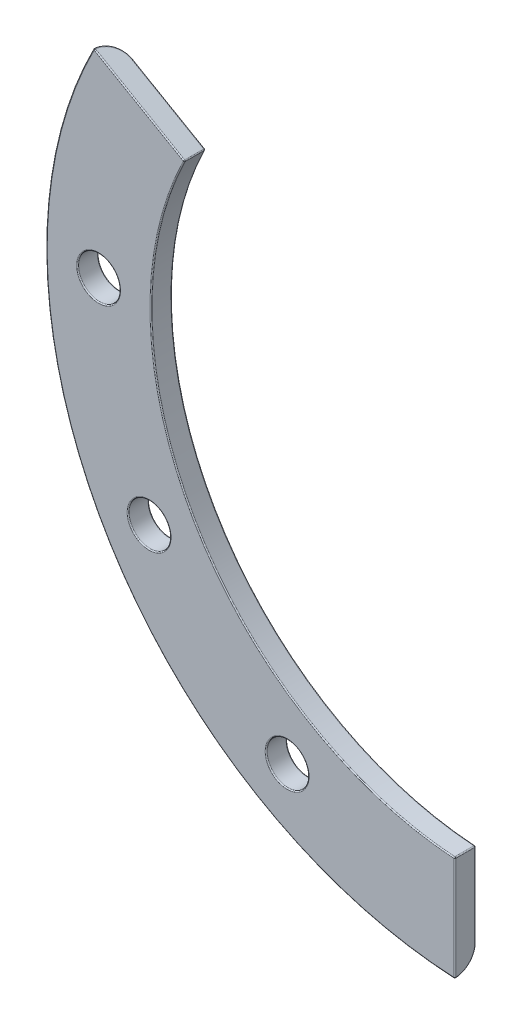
ISO-10303-21;
HEADER;
FILE_DESCRIPTION(('STEP AP214'),'2;1');
FILE_NAME('part.step','',(''),(''),'','','');
FILE_SCHEMA(('AUTOMOTIVE_DESIGN { 1 0 10303 214 1 1 1 1 }'));
ENDSEC;
DATA;
#1=APPLICATION_CONTEXT('core data for automotive mechanical design processes');
#2=APPLICATION_PROTOCOL_DEFINITION('international standard','automotive_design',2000,#1);
#3=PRODUCT_CONTEXT('',#1,'mechanical');
#4=PRODUCT('Part','Part','',(#3));
#5=PRODUCT_RELATED_PRODUCT_CATEGORY('part','',(#4));
#6=PRODUCT_DEFINITION_FORMATION('','',#4);
#7=PRODUCT_DEFINITION_CONTEXT('part definition',#1,'design');
#8=PRODUCT_DEFINITION('design','',#6,#7);
#9=PRODUCT_DEFINITION_SHAPE('','',#8);
#10=(LENGTH_UNIT() NAMED_UNIT(*) SI_UNIT(.MILLI.,.METRE.));
#11=(NAMED_UNIT(*) PLANE_ANGLE_UNIT() SI_UNIT($,.RADIAN.));
#12=(NAMED_UNIT(*) SI_UNIT($,.STERADIAN.) SOLID_ANGLE_UNIT());
#13=UNCERTAINTY_MEASURE_WITH_UNIT(LENGTH_MEASURE(1.E-05),#10,'distance_accuracy_value','');
#14=(GEOMETRIC_REPRESENTATION_CONTEXT(3) GLOBAL_UNCERTAINTY_ASSIGNED_CONTEXT((#13)) GLOBAL_UNIT_ASSIGNED_CONTEXT((#10,
#11,#12)) REPRESENTATION_CONTEXT('',''));
#15=CARTESIAN_POINT('',(0.,0.,0.));
#16=DIRECTION('',(0.,0.,1.));
#17=DIRECTION('',(1.,0.,0.));
#18=AXIS2_PLACEMENT_3D('',#15,#16,#17);
#19=CARTESIAN_POINT('',(0.,0.,5.));
#20=DIRECTION('',(0.,0.,1.));
#21=DIRECTION('',(1.,0.,0.));
#22=AXIS2_PLACEMENT_3D('',#19,#20,#21);
#23=PLANE('',#22);
#24=CARTESIAN_POINT('',(-90.0000000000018,-155.884572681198,5.));
#25=DIRECTION('',(0.,0.,1.));
#26=DIRECTION('',(1.,0.,0.));
#27=AXIS2_PLACEMENT_3D('',#24,#25,#26);
#28=CIRCLE('',#27,10.5);
#29=CARTESIAN_POINT('',(-79.5000000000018,-155.884572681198,5.));
#30=VERTEX_POINT('',#29);
#31=EDGE_CURVE('E455',#30,#30,#28,.F.);
#32=ORIENTED_EDGE('',*,*,#31,.T.);
#33=EDGE_LOOP('',(#32));
#34=FACE_BOUND('',#33,.T.);
#35=CARTESIAN_POINT('',(-155.884572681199,-89.9999999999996,5.));
#36=DIRECTION('',(0.,0.,1.));
#37=DIRECTION('',(1.,0.,0.));
#38=AXIS2_PLACEMENT_3D('',#35,#36,#37);
#39=CIRCLE('',#38,10.5);
#40=CARTESIAN_POINT('',(-145.384572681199,-89.9999999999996,5.));
#41=VERTEX_POINT('',#40);
#42=EDGE_CURVE('E453',#41,#41,#39,.F.);
#43=ORIENTED_EDGE('',*,*,#42,.T.);
#44=EDGE_LOOP('',(#43));
#45=FACE_BOUND('',#44,.T.);
#46=CARTESIAN_POINT('',(-180.,-1.25693328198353E-12,5.));
#47=DIRECTION('',(0.,0.,1.));
#48=DIRECTION('',(1.,0.,0.));
#49=AXIS2_PLACEMENT_3D('',#46,#47,#48);
#50=CIRCLE('',#49,10.5);
#51=CARTESIAN_POINT('',(-169.5,-1.25693328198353E-12,5.));
#52=VERTEX_POINT('',#51);
#53=EDGE_CURVE('E450',#52,#52,#50,.F.);
#54=ORIENTED_EDGE('',*,*,#53,.T.);
#55=EDGE_LOOP('',(#54));
#56=FACE_BOUND('',#55,.T.);
#57=DIRECTION('',(-0.866025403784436,0.500000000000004,0.));
#58=VECTOR('',#57,1.);
#59=CARTESIAN_POINT('',(-182.573856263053,93.2847094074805,5.));
#60=LINE('',#59,#58);
#61=CARTESIAN_POINT('',(-139.609592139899,68.479279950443,5.));
#62=VERTEX_POINT('',#61);
#63=CARTESIAN_POINT('',(-182.10717725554,93.015272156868,5.));
#64=VERTEX_POINT('',#63);
#65=EDGE_CURVE('E443',#62,#64,#60,.T.);
#66=ORIENTED_EDGE('',*,*,#65,.T.);
#67=CARTESIAN_POINT('',(0.,0.,5.));
#68=DIRECTION('',(0.,0.,1.));
#69=DIRECTION('',(1.,0.,0.));
#70=AXIS2_PLACEMENT_3D('',#67,#68,#69);
#71=CIRCLE('',#70,204.486832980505);
#72=CARTESIAN_POINT('',(-10.5,-204.217077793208,5.));
#73=VERTEX_POINT('',#72);
#74=EDGE_CURVE('E448',#64,#73,#71,.T.);
#75=ORIENTED_EDGE('',*,*,#74,.T.);
#76=DIRECTION('',(0.,1.,0.));
#77=VECTOR('',#76,1.);
#78=CARTESIAN_POINT('',(-10.5,-154.67708298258,5.));
#79=LINE('',#78,#77);
#80=CARTESIAN_POINT('',(-10.5,-155.145093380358,5.));
#81=VERTEX_POINT('',#80);
#82=EDGE_CURVE('E445',#73,#81,#79,.T.);
#83=ORIENTED_EDGE('',*,*,#82,.T.);
#84=CARTESIAN_POINT('',(0.,0.,5.));
#85=DIRECTION('',(0.,0.,1.));
#86=DIRECTION('',(1.,0.,0.));
#87=AXIS2_PLACEMENT_3D('',#84,#85,#86);
#88=CIRCLE('',#87,155.5);
#89=EDGE_CURVE('E441',#81,#62,#88,.F.);
#90=ORIENTED_EDGE('',*,*,#89,.T.);
#91=EDGE_LOOP('',(#66,#75,#83,#90));
#92=FACE_BOUND('',#91,.T.);
#93=ADVANCED_FACE('F31',(#34,#45,#56,#92),#23,.T.);
#94=CARTESIAN_POINT('',(0.,0.,-5.));
#95=DIRECTION('',(0.,0.,1.));
#96=DIRECTION('',(1.,0.,0.));
#97=AXIS2_PLACEMENT_3D('',#94,#95,#96);
#98=PLANE('',#97);
#99=CARTESIAN_POINT('',(-90.0000000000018,-155.884572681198,-5.));
#100=DIRECTION('',(0.,0.,1.));
#101=DIRECTION('',(1.,0.,0.));
#102=AXIS2_PLACEMENT_3D('',#99,#100,#101);
#103=CIRCLE('',#102,10.5);
#104=CARTESIAN_POINT('',(-79.5000000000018,-155.884572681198,-5.));
#105=VERTEX_POINT('',#104);
#106=EDGE_CURVE('E420',#105,#105,#103,.T.);
#107=ORIENTED_EDGE('',*,*,#106,.T.);
#108=EDGE_LOOP('',(#107));
#109=FACE_BOUND('',#108,.T.);
#110=CARTESIAN_POINT('',(-155.884572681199,-89.9999999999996,-5.));
#111=DIRECTION('',(0.,0.,1.));
#112=DIRECTION('',(1.,0.,0.));
#113=AXIS2_PLACEMENT_3D('',#110,#111,#112);
#114=CIRCLE('',#113,10.5);
#115=CARTESIAN_POINT('',(-145.384572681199,-89.9999999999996,-5.));
#116=VERTEX_POINT('',#115);
#117=EDGE_CURVE('E416',#116,#116,#114,.T.);
#118=ORIENTED_EDGE('',*,*,#117,.T.);
#119=EDGE_LOOP('',(#118));
#120=FACE_BOUND('',#119,.T.);
#121=CARTESIAN_POINT('',(-180.,-1.25693328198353E-12,-5.));
#122=DIRECTION('',(0.,0.,1.));
#123=DIRECTION('',(1.,0.,0.));
#124=AXIS2_PLACEMENT_3D('',#121,#122,#123);
#125=CIRCLE('',#124,10.5);
#126=CARTESIAN_POINT('',(-169.5,-1.25693328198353E-12,-5.));
#127=VERTEX_POINT('',#126);
#128=EDGE_CURVE('E414',#127,#127,#125,.T.);
#129=ORIENTED_EDGE('',*,*,#128,.T.);
#130=EDGE_LOOP('',(#129));
#131=FACE_BOUND('',#130,.T.);
#132=CARTESIAN_POINT('',(0.,0.,-5.));
#133=DIRECTION('',(0.,0.,1.));
#134=DIRECTION('',(1.,0.,0.));
#135=AXIS2_PLACEMENT_3D('',#132,#133,#134);
#136=CIRCLE('',#135,155.5);
#137=CARTESIAN_POINT('',(-139.609592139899,68.479279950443,-5.));
#138=VERTEX_POINT('',#137);
#139=CARTESIAN_POINT('',(-10.5,-155.145093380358,-5.));
#140=VERTEX_POINT('',#139);
#141=EDGE_CURVE('E459',#138,#140,#136,.T.);
#142=ORIENTED_EDGE('',*,*,#141,.T.);
#143=DIRECTION('',(0.,1.,0.));
#144=VECTOR('',#143,1.);
#145=CARTESIAN_POINT('',(-10.5,0.,-5.));
#146=LINE('',#145,#144);
#147=CARTESIAN_POINT('',(-10.5,-194.717102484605,-5.));
#148=VERTEX_POINT('',#147);
#149=EDGE_CURVE('E417',#140,#148,#146,.F.);
#150=ORIENTED_EDGE('',*,*,#149,.T.);
#151=CARTESIAN_POINT('',(0.,0.,-5.));
#152=DIRECTION('',(0.,0.,1.));
#153=DIRECTION('',(1.,0.,0.));
#154=AXIS2_PLACEMENT_3D('',#151,#152,#153);
#155=CIRCLE('',#154,195.);
#156=CARTESIAN_POINT('',(-173.879957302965,88.2652845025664,-5.));
#157=VERTEX_POINT('',#156);
#158=EDGE_CURVE('E156',#148,#157,#155,.F.);
#159=ORIENTED_EDGE('',*,*,#158,.T.);
#160=DIRECTION('',(-0.866025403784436,0.500000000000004,0.));
#161=VECTOR('',#160,1.);
#162=CARTESIAN_POINT('',(-5.25000000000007,-9.09326673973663,-5.));
#163=LINE('',#162,#161);
#164=EDGE_CURVE('E423',#157,#138,#163,.F.);
#165=ORIENTED_EDGE('',*,*,#164,.T.);
#166=EDGE_LOOP('',(#142,#150,#159,#165));
#167=FACE_BOUND('',#166,.T.);
#168=ADVANCED_FACE('F183',(#109,#120,#131,#167),#98,.F.);
#169=CARTESIAN_POINT('',(-9.99999999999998,-154.67708298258,5.));
#170=DIRECTION('',(-1.,0.,0.));
#171=DIRECTION('',(0.,-1.,0.));
#172=AXIS2_PLACEMENT_3D('',#169,#170,#171);
#173=PLANE('',#172);
#174=DIRECTION('',(0.,1.,0.));
#175=VECTOR('',#174,1.);
#176=CARTESIAN_POINT('',(-9.99999999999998,-154.67708298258,-4.5));
#177=LINE('',#176,#175);
#178=CARTESIAN_POINT('',(-9.99999999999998,-194.717102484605,-4.5));
#179=VERTEX_POINT('',#178);
#180=CARTESIAN_POINT('',(-9.99999999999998,-155.145093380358,-4.5));
#181=VERTEX_POINT('',#180);
#182=EDGE_CURVE('E173',#179,#181,#177,.T.);
#183=ORIENTED_EDGE('',*,*,#182,.T.);
#184=DIRECTION('',(0.,0.,-1.));
#185=VECTOR('',#184,1.);
#186=CARTESIAN_POINT('',(-9.99999999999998,-155.145093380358,5.));
#187=LINE('',#186,#185);
#188=CARTESIAN_POINT('',(-9.99999999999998,-155.145093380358,4.5));
#189=VERTEX_POINT('',#188);
#190=EDGE_CURVE('E460',#181,#189,#187,.F.);
#191=ORIENTED_EDGE('',*,*,#190,.T.);
#192=DIRECTION('',(0.,1.,0.));
#193=VECTOR('',#192,1.);
#194=CARTESIAN_POINT('',(-9.99999999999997,-204.755952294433,4.5));
#195=LINE('',#194,#193);
#196=CARTESIAN_POINT('',(-9.99999999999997,-204.217077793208,4.5));
#197=VERTEX_POINT('',#196);
#198=EDGE_CURVE('E164',#189,#197,#195,.F.);
#199=ORIENTED_EDGE('',*,*,#198,.T.);
#200=CARTESIAN_POINT('',(-9.99999999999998,-191.564257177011,-3.96319478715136));
#201=CARTESIAN_POINT('',(-9.99999999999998,-191.401758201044,-4.42653829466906));
#202=CARTESIAN_POINT('',(-10.490931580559,-191.398810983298,-4.43494188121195));
#203=CARTESIAN_POINT('',(-9.99999999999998,-191.817045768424,-4.05187711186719));
#204=CARTESIAN_POINT('',(-9.99999999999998,-191.667536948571,-4.52054807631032));
#205=CARTESIAN_POINT('',(-10.4916706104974,-191.66486372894,-4.52829169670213));
#206=CARTESIAN_POINT('',(-9.99999999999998,-192.073580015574,-4.12984160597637));
#207=CARTESIAN_POINT('',(-9.99999999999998,-191.937115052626,-4.60322868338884));
#208=CARTESIAN_POINT('',(-10.4924176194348,-191.934858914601,-4.61035958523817));
#209=CARTESIAN_POINT('',(-9.99999999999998,-192.592288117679,-4.26389924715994));
#210=CARTESIAN_POINT('',(-9.99999999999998,-192.482305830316,-4.74566315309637));
#211=CARTESIAN_POINT('',(-10.4939219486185,-192.480785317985,-4.7514728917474));
#212=CARTESIAN_POINT('',(-9.99999999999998,-192.854461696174,-4.31999346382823));
#213=CARTESIAN_POINT('',(-9.99999999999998,-192.757933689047,-4.80538576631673));
#214=CARTESIAN_POINT('',(-10.4946792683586,-192.756716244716,-4.8105194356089));
#215=CARTESIAN_POINT('',(-9.99999999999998,-193.382446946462,-4.40985385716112));
#216=CARTESIAN_POINT('',(-9.99999999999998,-193.313124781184,-4.90140367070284));
#217=CARTESIAN_POINT('',(-10.4961981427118,-193.312407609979,-4.90510932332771));
#218=CARTESIAN_POINT('',(-9.99999999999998,-193.648256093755,-4.44363479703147));
#219=CARTESIAN_POINT('',(-9.99999999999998,-193.592695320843,-4.93767989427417));
#220=CARTESIAN_POINT('',(-10.4969596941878,-193.592165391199,-4.9406682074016));
#221=CARTESIAN_POINT('',(-9.99999999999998,-194.181698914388,-4.48871515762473));
#222=CARTESIAN_POINT('',(-9.99999999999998,-194.153878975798,-4.98662489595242));
#223=CARTESIAN_POINT('',(-10.4984817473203,-194.153601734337,-4.98812121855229));
#224=CARTESIAN_POINT('',(-9.99999999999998,-194.449332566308,-4.50001484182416));
#225=CARTESIAN_POINT('',(-9.99999999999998,-194.435495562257,-4.99925816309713));
#226=CARTESIAN_POINT('',(-10.4992422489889,-194.435280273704,-5.00001562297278));
#227=CARTESIAN_POINT('',(-9.99999999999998,-195.252318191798,-4.49997033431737));
#228=CARTESIAN_POINT('',(-9.99999999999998,-195.281256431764,-5.00148615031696));
#229=CARTESIAN_POINT('',(-10.5015145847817,-195.280405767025,-4.99996877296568));
#230=CARTESIAN_POINT('',(-9.99999999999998,-195.788078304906,-4.45473733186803));
#231=CARTESIAN_POINT('',(-9.99999999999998,-195.845362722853,-4.95524782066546));
#232=CARTESIAN_POINT('',(-10.5030181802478,-195.844283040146,-4.95235508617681));
#233=CARTESIAN_POINT('',(-9.99999999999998,-196.844008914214,-4.27499728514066));
#234=CARTESIAN_POINT('',(-9.99999999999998,-196.957722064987,-4.76891466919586));
#235=CARTESIAN_POINT('',(-10.5059581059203,-196.955631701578,-4.76315503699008));
#236=CARTESIAN_POINT('',(-9.99999999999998,-197.364182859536,-4.14051014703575));
#237=CARTESIAN_POINT('',(-9.99999999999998,-197.505864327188,-4.62857289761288));
#238=CARTESIAN_POINT('',(-10.5073944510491,-197.503106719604,-4.62158962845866));
#239=CARTESIAN_POINT('',(-9.99999999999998,-198.374614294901,-3.78616081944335));
#240=CARTESIAN_POINT('',(-9.99999999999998,-198.57122932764,-4.25794719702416));
#241=CARTESIAN_POINT('',(-10.5101638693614,-198.566571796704,-4.24859033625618));
#242=CARTESIAN_POINT('',(-9.99999999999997,-198.864870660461,-3.56629542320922));
#243=CARTESIAN_POINT('',(-9.99999999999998,-199.088257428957,-4.02744252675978));
#244=CARTESIAN_POINT('',(-10.5114969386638,-199.082560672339,-4.01715307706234));
#245=CARTESIAN_POINT('',(-9.99999999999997,-199.801766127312,-3.0470616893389));
#246=CARTESIAN_POINT('',(-9.99999999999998,-200.076911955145,-3.48249698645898));
#247=CARTESIAN_POINT('',(-10.5140273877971,-200.068633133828,-3.47059125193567));
#248=CARTESIAN_POINT('',(-9.99999999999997,-200.248395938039,-2.74767646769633));
#249=CARTESIAN_POINT('',(-9.99999999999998,-200.548276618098,-3.16789346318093));
#250=CARTESIAN_POINT('',(-10.5152247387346,-200.538706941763,-3.15544891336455));
#251=CARTESIAN_POINT('',(-9.99999999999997,-200.875335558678,-2.24600615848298));
#252=CARTESIAN_POINT('',(-9.99999999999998,-201.209974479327,-2.64061970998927));
#253=CARTESIAN_POINT('',(-10.5168957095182,-201.198555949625,-2.62737490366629));
#254=CARTESIAN_POINT('',(-9.99999999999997,-201.077182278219,-2.06997875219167));
#255=CARTESIAN_POINT('',(-9.99999999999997,-201.423154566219,-2.45543101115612));
#256=CARTESIAN_POINT('',(-10.5174319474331,-201.410998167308,-2.44208289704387));
#257=CARTESIAN_POINT('',(-9.99999999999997,-201.465299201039,-1.7015536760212));
#258=CARTESIAN_POINT('',(-9.99999999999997,-201.833164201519,-2.06769590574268));
#259=CARTESIAN_POINT('',(-10.5184601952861,-201.819488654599,-2.0542670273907));
#260=CARTESIAN_POINT('',(-9.99999999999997,-201.651575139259,-1.50916208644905));
#261=CARTESIAN_POINT('',(-9.99999999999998,-202.029964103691,-1.86515466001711));
#262=CARTESIAN_POINT('',(-10.518952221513,-202.015542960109,-1.85174956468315));
#263=CARTESIAN_POINT('',(-9.99999999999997,-202.007244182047,-1.10933209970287));
#264=CARTESIAN_POINT('',(-9.99999999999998,-202.405815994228,-1.44410387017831));
#265=CARTESIAN_POINT('',(-10.5198893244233,-202.389882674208,-1.43087589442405));
#266=CARTESIAN_POINT('',(-9.99999999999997,-202.176634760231,-0.901891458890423));
#267=CARTESIAN_POINT('',(-9.99999999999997,-202.584829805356,-1.22559674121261));
#268=CARTESIAN_POINT('',(-10.5203343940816,-202.568165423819,-1.21251732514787));
#269=CARTESIAN_POINT('',(-9.99999999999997,-202.497250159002,-0.473531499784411));
#270=CARTESIAN_POINT('',(-9.99999999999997,-202.923736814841,-0.774262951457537));
#271=CARTESIAN_POINT('',(-10.5211749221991,-202.905611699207,-0.761612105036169));
#272=CARTESIAN_POINT('',(-9.99999999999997,-202.648481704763,-0.25261721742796));
#273=CARTESIAN_POINT('',(-9.99999999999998,-203.083603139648,-0.541451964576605));
#274=CARTESIAN_POINT('',(-10.5215703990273,-203.064782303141,-0.529070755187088));
#275=CARTESIAN_POINT('',(-9.99999999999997,-202.93162675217,0.200968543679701));
#276=CARTESIAN_POINT('',(-9.99999999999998,-203.382979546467,-0.0633253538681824));
#277=CARTESIAN_POINT('',(-10.5223093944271,-203.362791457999,-0.0516120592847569));
#278=CARTESIAN_POINT('',(-9.99999999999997,-203.063558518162,0.433628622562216));
#279=CARTESIAN_POINT('',(-9.99999999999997,-203.522477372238,0.181962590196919));
#280=CARTESIAN_POINT('',(-10.5226529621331,-203.501649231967,0.193293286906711));
#281=CARTESIAN_POINT('',(-9.99999999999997,-203.307286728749,0.909158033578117));
#282=CARTESIAN_POINT('',(-9.99999999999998,-203.780235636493,0.683407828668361));
#283=CARTESIAN_POINT('',(-10.5232866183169,-203.758172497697,0.693850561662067));
#284=CARTESIAN_POINT('',(-9.99999999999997,-203.419090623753,1.15202354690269));
#285=CARTESIAN_POINT('',(-9.99999999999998,-203.89847556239,0.939540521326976));
#286=CARTESIAN_POINT('',(-10.5235767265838,-203.87584583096,0.949498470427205));
#287=CARTESIAN_POINT('',(-9.99999999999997,-203.621880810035,1.64646173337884));
#288=CARTESIAN_POINT('',(-9.99999999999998,-204.112980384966,1.46108517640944));
#289=CARTESIAN_POINT('',(-10.52410222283,-204.089282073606,1.46995971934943));
#290=CARTESIAN_POINT('',(-9.99999999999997,-203.712854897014,1.89803941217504));
#291=CARTESIAN_POINT('',(-9.99999999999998,-204.20920785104,1.7264774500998));
#292=CARTESIAN_POINT('',(-10.5243375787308,-204.185032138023,1.73477832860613));
#293=CARTESIAN_POINT('',(-9.99999999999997,-203.873218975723,2.40788003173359));
#294=CARTESIAN_POINT('',(-9.99999999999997,-204.378862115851,2.26439971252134));
#295=CARTESIAN_POINT('',(-10.5247520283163,-204.353815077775,2.2714526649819));
#296=CARTESIAN_POINT('',(-9.99999999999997,-203.942616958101,2.66614045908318));
#297=CARTESIAN_POINT('',(-9.99999999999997,-204.452277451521,2.53689851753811));
#298=CARTESIAN_POINT('',(-10.5249311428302,-204.426856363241,2.54330574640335));
#299=CARTESIAN_POINT('',(-9.99999999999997,-204.059290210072,3.18721417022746));
#300=CARTESIAN_POINT('',(-9.99999999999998,-204.575724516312,3.0867726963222));
#301=CARTESIAN_POINT('',(-10.5252320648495,-204.549654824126,3.09180438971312));
#302=CARTESIAN_POINT('',(-9.99999999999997,-204.106597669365,3.45002024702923));
#303=CARTESIAN_POINT('',(-9.99999999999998,-204.625775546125,3.36410923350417));
#304=CARTESIAN_POINT('',(-10.525353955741,-204.599445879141,3.36844236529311));
#305=CARTESIAN_POINT('',(-9.99999999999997,-204.178903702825,3.97868693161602));
#306=CARTESIAN_POINT('',(-9.99999999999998,-204.70228555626,3.9220645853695));
#307=CARTESIAN_POINT('',(-10.5255401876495,-204.675547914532,3.92493361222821));
#308=CARTESIAN_POINT('',(-9.99999999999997,-204.203902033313,4.24454757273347));
#309=CARTESIAN_POINT('',(-9.99999999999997,-204.728735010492,4.20265025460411));
#310=CARTESIAN_POINT('',(-10.5256045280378,-204.701858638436,4.20478691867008));
#311=CARTESIAN_POINT('',(-9.99999999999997,-204.231410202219,4.7776156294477));
#312=CARTESIAN_POINT('',(-9.99999999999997,-204.757844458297,4.76528707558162));
#313=CARTESIAN_POINT('',(-10.525675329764,-204.730810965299,4.76591118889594));
#314=CARTESIAN_POINT('',(-9.99999999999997,-204.233904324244,5.04482385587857));
#315=CARTESIAN_POINT('',(-9.99999999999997,-204.760484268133,5.04730480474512));
#316=CARTESIAN_POINT('',(-10.5256817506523,-204.733436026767,5.04718300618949));
#317=CARTESIAN_POINT('',(-9.99999999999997,-204.216378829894,5.57851372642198));
#318=CARTESIAN_POINT('',(-9.99999999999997,-204.741936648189,5.6106013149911));
#319=CARTESIAN_POINT('',(-10.5256366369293,-204.714990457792,5.60896181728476));
#320=CARTESIAN_POINT('',(-9.99999999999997,-204.196358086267,5.84499533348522));
#321=CARTESIAN_POINT('',(-9.99999999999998,-204.720750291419,5.89184568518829));
#322=CARTESIAN_POINT('',(-10.5255850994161,-204.693918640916,5.88946877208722));
#323=CARTESIAN_POINT('',(-9.99999999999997,-204.16508768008,6.11015565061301));
#324=CARTESIAN_POINT('',(-9.99999999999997,-204.687662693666,6.17172552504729));
#325=CARTESIAN_POINT('',(-10.5255045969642,-204.661006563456,6.16858489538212));
#326=(BOUNDED_SURFACE() B_SPLINE_SURFACE(3,2,((#200,#201,#202),(#203,#204,#205),(#206,#207,
#208),(#209,#210,#211),(#212,#213,#214),(#215,#216,#217),(#218,#219,#220),(#221,#222,#223),
(#224,#225,#226),(#227,#228,#229),(#230,#231,#232),(#233,#234,#235),(#236,#237,#238),(#239,#240,
#241),(#242,#243,#244),(#245,#246,#247),(#248,#249,#250),(#251,#252,#253),(#254,#255,#256),
(#257,#258,#259),(#260,#261,#262),(#263,#264,#265),(#266,#267,#268),(#269,#270,#271),(#272,#273,
#274),(#275,#276,#277),(#278,#279,#280),(#281,#282,#283),(#284,#285,#286),(#287,#288,#289),
(#290,#291,#292),(#293,#294,#295),(#296,#297,#298),(#299,#300,#301),(#302,#303,#304),(#305,#306,
#307),(#308,#309,#310),(#311,#312,#313),(#314,#315,#316),(#317,#318,#319),(#320,#321,#322),
(#323,#324,#325)),.UNSPECIFIED.,.F.,.F.,.F.) B_SPLINE_SURFACE_WITH_KNOTS((4,2,2,2,2,2,2,2,2,2,2,
2,2,2,2,2,2,2,2,2,4),(3,3),(0.,0.803417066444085,1.60679483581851,2.40964052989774,
3.21247681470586,4.81717756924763,6.42152055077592,8.02592379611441,9.63066796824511,
10.4333460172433,11.235727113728,12.038228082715,12.8404309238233,13.6418696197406,
14.4430110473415,15.2446206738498,16.0459330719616,16.8460741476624,17.6462239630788,
18.4469325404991,19.2476812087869),(0.,1.),
.UNSPECIFIED.) GEOMETRIC_REPRESENTATION_ITEM() RATIONAL_B_SPLINE_SURFACE(((1.,0.713490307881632,
1.),(1.,0.712972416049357,1.),(1.,0.712448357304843,1.),(1.,0.711391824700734,1.),(1.,
0.710859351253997,1.),(1.,0.709790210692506,1.),(1.,0.709253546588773,1.),(1.,0.708179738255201,
1.),(1.,0.707642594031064,1.),(1.,0.706035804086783,1.),(1.,0.704970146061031,1.),(1.,
0.702881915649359,1.),(1.,0.701859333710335,1.),(1.,0.699883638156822,1.),(1.,0.698930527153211,
1.),(1.,0.697117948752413,1.),(1.,0.696258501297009,1.),(1.,0.695057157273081,1.),(1.,
0.694671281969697,1.),(1.,0.69393079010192,1.),(1.,0.6935761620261,1.),(1.,0.692900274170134,
1.),(1.,0.692579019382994,1.),(1.,0.691971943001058,1.),(1.,0.691686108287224,1.),(1.,
0.691151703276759,1.),(1.,0.690903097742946,1.),(1.,0.690444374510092,1.),(1.,0.690234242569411,
1.),(1.,0.689853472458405,1.),(1.,0.689682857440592,1.),(1.,0.689382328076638,1.),(1.,
0.689252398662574,1.),(1.,0.68903406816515,1.),(1.,0.688945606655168,1.),(1.,0.688810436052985,
1.),(1.,0.688763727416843,1.),(1.,0.688712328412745,1.),(1.,0.688707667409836,1.),(1.,
0.688740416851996,1.),(1.,0.688777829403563,1.),(1.,0.688836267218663,1.))) REPRESENTATION_ITEM('') SURFACE());
#327=CARTESIAN_POINT('',(-9.99999999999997,-204.16508768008,6.11015565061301));
#328=CARTESIAN_POINT('',(-9.99999999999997,-204.196358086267,5.84499533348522));
#329=CARTESIAN_POINT('',(-9.99999999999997,-204.216378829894,5.57851372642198));
#330=CARTESIAN_POINT('',(-9.99999999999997,-204.233904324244,5.04482385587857));
#331=CARTESIAN_POINT('',(-9.99999999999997,-204.231410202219,4.7776156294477));
#332=CARTESIAN_POINT('',(-9.99999999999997,-204.203902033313,4.24454757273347));
#333=CARTESIAN_POINT('',(-9.99999999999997,-204.178903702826,3.97868693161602));
#334=CARTESIAN_POINT('',(-9.99999999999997,-204.106597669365,3.45002024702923));
#335=CARTESIAN_POINT('',(-9.99999999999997,-204.059290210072,3.18721417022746));
#336=CARTESIAN_POINT('',(-9.99999999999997,-203.942616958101,2.66614045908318));
#337=CARTESIAN_POINT('',(-9.99999999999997,-203.873218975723,2.40788003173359));
#338=CARTESIAN_POINT('',(-9.99999999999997,-203.712854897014,1.89803941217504));
#339=CARTESIAN_POINT('',(-9.99999999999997,-203.621880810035,1.64646173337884));
#340=CARTESIAN_POINT('',(-9.99999999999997,-203.419090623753,1.15202354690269));
#341=CARTESIAN_POINT('',(-9.99999999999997,-203.307286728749,0.909158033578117));
#342=CARTESIAN_POINT('',(-9.99999999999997,-203.063558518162,0.433628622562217));
#343=CARTESIAN_POINT('',(-9.99999999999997,-202.93162675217,0.200968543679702));
#344=CARTESIAN_POINT('',(-9.99999999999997,-202.648481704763,-0.25261721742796));
#345=CARTESIAN_POINT('',(-9.99999999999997,-202.497250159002,-0.473531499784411));
#346=CARTESIAN_POINT('',(-9.99999999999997,-202.176634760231,-0.901891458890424));
#347=CARTESIAN_POINT('',(-9.99999999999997,-202.007244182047,-1.10933209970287));
#348=CARTESIAN_POINT('',(-9.99999999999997,-201.651575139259,-1.50916208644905));
#349=CARTESIAN_POINT('',(-9.99999999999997,-201.465299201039,-1.7015536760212));
#350=CARTESIAN_POINT('',(-9.99999999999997,-201.077182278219,-2.06997875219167));
#351=CARTESIAN_POINT('',(-9.99999999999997,-200.875335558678,-2.24600615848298));
#352=CARTESIAN_POINT('',(-9.99999999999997,-200.248395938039,-2.74767646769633));
#353=CARTESIAN_POINT('',(-9.99999999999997,-199.801766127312,-3.0470616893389));
#354=CARTESIAN_POINT('',(-9.99999999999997,-198.864870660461,-3.56629542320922));
#355=CARTESIAN_POINT('',(-9.99999999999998,-198.374614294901,-3.78616081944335));
#356=CARTESIAN_POINT('',(-9.99999999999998,-197.364182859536,-4.14051014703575));
#357=CARTESIAN_POINT('',(-9.99999999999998,-196.844008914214,-4.27499728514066));
#358=CARTESIAN_POINT('',(-9.99999999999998,-195.788078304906,-4.45473733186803));
#359=CARTESIAN_POINT('',(-9.99999999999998,-195.252318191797,-4.49997033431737));
#360=CARTESIAN_POINT('',(-9.99999999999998,-194.449332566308,-4.50001484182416));
#361=CARTESIAN_POINT('',(-9.99999999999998,-194.181698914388,-4.48871515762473));
#362=CARTESIAN_POINT('',(-9.99999999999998,-193.648256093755,-4.44363479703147));
#363=CARTESIAN_POINT('',(-9.99999999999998,-193.382446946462,-4.40985385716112));
#364=CARTESIAN_POINT('',(-9.99999999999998,-192.854461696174,-4.31999346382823));
#365=CARTESIAN_POINT('',(-9.99999999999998,-192.592288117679,-4.26389924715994));
#366=CARTESIAN_POINT('',(-9.99999999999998,-192.073580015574,-4.12984160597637));
#367=CARTESIAN_POINT('',(-9.99999999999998,-191.817045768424,-4.05187711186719));
#368=CARTESIAN_POINT('',(-9.99999999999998,-191.564257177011,-3.96319478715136));
#369=B_SPLINE_CURVE_WITH_KNOTS('',3,(#327,#328,#329,#330,#331,#332,#333,#334,#335,#336,#337,
#338,#339,#340,#341,#342,#343,#344,#345,#346,#347,#348,#349,#350,#351,#352,#353,#354,#355,#356,
#357,#358,#359,#360,#361,#362,#363,#364,#365,#366,#367,#368),.UNSPECIFIED.,.F.,.F.,(4,2,2,2,2,2,
2,2,2,2,2,2,2,2,2,2,2,2,2,2,4),(0.,0.80074866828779,1.6014572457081,2.40160706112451,
3.20174813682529,4.0030605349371,4.80467016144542,5.60581158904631,6.40725028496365,
7.20945312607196,8.01195409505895,8.8143351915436,9.61701324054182,11.2217574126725,
12.826160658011,14.4305036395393,16.0352043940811,16.8380406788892,17.6408863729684,
18.4442641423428,19.2476812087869),.UNSPECIFIED.);
#370=EDGE_CURVE('E166',#197,#179,#369,.T.);
#371=ORIENTED_EDGE('',*,*,#370,.T.);
#372=EDGE_LOOP('',(#183,#191,#199,#371));
#373=FACE_BOUND('',#372,.T.);
#374=ADVANCED_FACE('F179',(#373),#173,.F.);
#375=CARTESIAN_POINT('',(0.,0.,5.));
#376=DIRECTION('',(0.,0.,-1.));
#377=DIRECTION('',(-1.,0.,0.));
#378=AXIS2_PLACEMENT_3D('',#375,#376,#377);
#379=CYLINDRICAL_SURFACE('',#378,155.);
#380=DIRECTION('',(0.,0.,-1.));
#381=VECTOR('',#380,1.);
#382=CARTESIAN_POINT('',(-10.4662379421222,-154.646234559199,5.));
#383=LINE('',#382,#381);
#384=CARTESIAN_POINT('',(-10.4662379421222,-154.646234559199,4.5));
#385=VERTEX_POINT('',#384);
#386=CARTESIAN_POINT('',(-10.4662379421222,-154.646234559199,-4.5));
#387=VERTEX_POINT('',#386);
#388=EDGE_CURVE('E132',#385,#387,#383,.T.);
#389=ORIENTED_EDGE('',*,*,#388,.T.);
#390=CARTESIAN_POINT('',(0.,0.,-4.5));
#391=DIRECTION('',(0.,0.,1.));
#392=DIRECTION('',(1.,0.,0.));
#393=AXIS2_PLACEMENT_3D('',#390,#391,#392);
#394=CIRCLE('',#393,155.);
#395=CARTESIAN_POINT('',(-139.160686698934,68.2590893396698,-4.5));
#396=VERTEX_POINT('',#395);
#397=EDGE_CURVE('E128',#387,#396,#394,.F.);
#398=ORIENTED_EDGE('',*,*,#397,.T.);
#399=DIRECTION('',(0.,0.,-1.));
#400=VECTOR('',#399,1.);
#401=CARTESIAN_POINT('',(-139.160686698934,68.2590893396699,5.));
#402=LINE('',#401,#400);
#403=CARTESIAN_POINT('',(-139.160686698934,68.2590893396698,4.5));
#404=VERTEX_POINT('',#403);
#405=EDGE_CURVE('E120',#396,#404,#402,.F.);
#406=ORIENTED_EDGE('',*,*,#405,.T.);
#407=CARTESIAN_POINT('',(0.,0.,4.5));
#408=DIRECTION('',(0.,0.,1.));
#409=DIRECTION('',(1.,0.,0.));
#410=AXIS2_PLACEMENT_3D('',#407,#408,#409);
#411=CIRCLE('',#410,155.);
#412=EDGE_CURVE('E125',#404,#385,#411,.T.);
#413=ORIENTED_EDGE('',*,*,#412,.T.);
#414=EDGE_LOOP('',(#389,#398,#406,#413));
#415=FACE_BOUND('',#414,.T.);
#416=ADVANCED_FACE('F123',(#415),#379,.F.);
#417=CARTESIAN_POINT('',(-182.323856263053,93.7177221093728,5.));
#418=DIRECTION('',(-0.500000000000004,-0.866025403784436,0.));
#419=DIRECTION('',(0.866025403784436,-0.500000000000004,0.));
#420=AXIS2_PLACEMENT_3D('',#417,#418,#419);
#421=PLANE('',#420);
#422=DIRECTION('',(-0.866025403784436,0.500000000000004,0.));
#423=VECTOR('',#422,1.);
#424=CARTESIAN_POINT('',(-138.954283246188,68.6782874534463,4.5));
#425=LINE('',#424,#423);
#426=CARTESIAN_POINT('',(-181.85717725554,93.4482848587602,4.5));
#427=VERTEX_POINT('',#426);
#428=CARTESIAN_POINT('',(-139.359592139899,68.9122926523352,4.5));
#429=VERTEX_POINT('',#428);
#430=EDGE_CURVE('E53',#427,#429,#425,.F.);
#431=ORIENTED_EDGE('',*,*,#430,.T.);
#432=DIRECTION('',(0.,0.,-1.));
#433=VECTOR('',#432,1.);
#434=CARTESIAN_POINT('',(-139.359592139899,68.9122926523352,5.));
#435=LINE('',#434,#433);
#436=CARTESIAN_POINT('',(-139.359592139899,68.9122926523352,-4.5));
#437=VERTEX_POINT('',#436);
#438=EDGE_CURVE('E138',#429,#437,#435,.T.);
#439=ORIENTED_EDGE('',*,*,#438,.T.);
#440=DIRECTION('',(-0.866025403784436,0.500000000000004,0.));
#441=VECTOR('',#440,1.);
#442=CARTESIAN_POINT('',(-182.323856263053,93.7177221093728,-4.5));
#443=LINE('',#442,#441);
#444=CARTESIAN_POINT('',(-173.629957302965,88.6982972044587,-4.5));
#445=VERTEX_POINT('',#444);
#446=EDGE_CURVE('E258',#437,#445,#443,.T.);
#447=ORIENTED_EDGE('',*,*,#446,.T.);
#448=CARTESIAN_POINT('',(-171.001698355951,86.6139922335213,-4.43494188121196));
#449=CARTESIAN_POINT('',(-170.75878493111,87.0406250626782,-4.42653829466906));
#450=CARTESIAN_POINT('',(-170.899513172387,87.1218745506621,-3.96319478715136));
#451=CARTESIAN_POINT('',(-171.232476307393,86.7463785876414,-4.52829169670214));
#452=CARTESIAN_POINT('',(-170.988956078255,87.1735144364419,-4.52054807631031));
#453=CARTESIAN_POINT('',(-171.118434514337,87.2482688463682,-4.05187711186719));
#454=CARTESIAN_POINT('',(-171.466672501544,86.8807292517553,-4.61035958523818));
#455=CARTESIAN_POINT('',(-171.22241756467,87.3083034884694,-4.60322868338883));
#456=CARTESIAN_POINT('',(-171.34059968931,87.3765359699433,-4.12984160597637));
#457=CARTESIAN_POINT('',(-171.940210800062,87.1523896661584,-4.7514728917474));
#458=CARTESIAN_POINT('',(-171.694566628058,87.5808988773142,-4.74566315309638));
#459=CARTESIAN_POINT('',(-171.789814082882,87.6358900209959,-4.26389924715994));
#460=CARTESIAN_POINT('',(-172.179552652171,87.2896992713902,-4.8105194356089));
#461=CARTESIAN_POINT('',(-171.933267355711,87.7187128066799,-4.80538576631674));
#462=CARTESIAN_POINT('',(-172.016863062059,87.7669768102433,-4.31999346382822));
#463=CARTESIAN_POINT('',(-172.661554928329,87.5662295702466,-4.90510932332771));
#464=CARTESIAN_POINT('',(-172.414076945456,87.9963083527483,-4.90140367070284));
#465=CARTESIAN_POINT('',(-172.474111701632,88.0309694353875,-4.40985385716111));
#466=CARTESIAN_POINT('',(-172.904213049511,87.7054489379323,-4.9406682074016));
#467=CARTESIAN_POINT('',(-172.65619213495,88.1360936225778,-4.93767989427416));
#468=CARTESIAN_POINT('',(-172.704309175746,88.163874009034,-4.44363479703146));
#469=CARTESIAN_POINT('',(-173.391192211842,87.9848489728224,-4.98812121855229));
#470=CARTESIAN_POINT('',(-173.14219143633,88.4166854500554,-4.98662489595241));
#471=CARTESIAN_POINT('',(-173.166284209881,88.4305954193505,-4.48871515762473));
#472=CARTESIAN_POINT('',(-173.635513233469,88.1250296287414,-5.00001562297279));
#473=CARTESIAN_POINT('',(-173.38607855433,88.5574937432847,-4.99925816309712));
#474=CARTESIAN_POINT('',(-173.398061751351,88.5644122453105,-4.50001484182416));
#475=CARTESIAN_POINT('',(-174.368549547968,88.5456244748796,-4.99996877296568));
#476=CARTESIAN_POINT('',(-174.118528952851,88.9803741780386,-5.00148615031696));
#477=CARTESIAN_POINT('',(-174.093467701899,88.9659050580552,-4.49997033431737));
#478=CARTESIAN_POINT('',(-174.85763338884,88.8262609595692,-4.95235508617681));
#479=CARTESIAN_POINT('',(-174.607059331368,89.2624273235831,-4.95524782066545));
#480=CARTESIAN_POINT('',(-174.557449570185,89.2337851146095,-4.45473733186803));
#481=CARTESIAN_POINT('',(-175.821559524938,89.3793892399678,-4.76315503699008));
#482=CARTESIAN_POINT('',(-175.570390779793,89.81860699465,-4.76891466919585));
#483=CARTESIAN_POINT('',(-175.47191230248,89.7617504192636,-4.27499728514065));
#484=CARTESIAN_POINT('',(-176.29640497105,89.6518828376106,-4.62158962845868));
#485=CARTESIAN_POINT('',(-176.045095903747,90.0926781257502,-4.62857289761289));
#486=CARTESIAN_POINT('',(-175.922396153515,90.0218373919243,-4.14051014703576));
#487=CARTESIAN_POINT('',(-177.218777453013,90.1812169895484,-4.24859033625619));
#488=CARTESIAN_POINT('',(-176.967729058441,90.6253606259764,-4.25794719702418));
#489=CARTESIAN_POINT('',(-176.797455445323,90.5270531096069,-3.78616081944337));
#490=CARTESIAN_POINT('',(-177.666303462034,90.4380569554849,-4.01715307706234));
#491=CARTESIAN_POINT('',(-177.415488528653,90.883874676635,-4.02744252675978));
#492=CARTESIAN_POINT('',(-177.222029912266,90.7721812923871,-3.56629542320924));
#493=CARTESIAN_POINT('',(-178.521532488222,90.9289017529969,-3.47059125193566));
#494=CARTESIAN_POINT('',(-178.271688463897,91.3782019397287,-3.48249698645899));
#495=CARTESIAN_POINT('',(-178.033405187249,91.2406290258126,-3.04706168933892));
#496=CARTESIAN_POINT('',(-178.929227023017,91.1629017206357,-3.15544891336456));
#497=CARTESIAN_POINT('',(-178.679902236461,91.6138842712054,-3.16789346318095));
#498=CARTESIAN_POINT('',(-178.420197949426,91.463943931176,-2.74767646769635));
#499=CARTESIAN_POINT('',(-179.501508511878,91.4913791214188,-2.62737490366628));
#500=CARTESIAN_POINT('',(-179.252949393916,91.94473320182,-2.64061970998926));
#501=CARTESIAN_POINT('',(-178.963143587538,91.7774137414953,-2.24600615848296));
#502=CARTESIAN_POINT('',(-179.685756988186,91.5971358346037,-2.44208289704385));
#503=CARTESIAN_POINT('',(-179.437568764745,92.0513232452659,-2.45543101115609));
#504=CARTESIAN_POINT('',(-179.137947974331,91.8783371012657,-2.06997875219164));
#505=CARTESIAN_POINT('',(-180.040034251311,91.8004905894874,-2.05426702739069));
#506=CARTESIAN_POINT('',(-179.792647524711,92.2563280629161,-2.06769590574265));
#507=CARTESIAN_POINT('',(-179.474067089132,92.0723955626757,-1.70155367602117));
#508=CARTESIAN_POINT('',(-180.210068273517,91.8980916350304,-1.85174956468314));
#509=CARTESIAN_POINT('',(-179.963081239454,92.3547280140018,-1.86515466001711));
#510=CARTESIAN_POINT('',(-179.635386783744,92.1655335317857,-1.50916208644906));
#511=CARTESIAN_POINT('',(-180.534724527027,92.0844499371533,-1.43087589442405));
#512=CARTESIAN_POINT('',(-180.28857852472,92.5426539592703,-1.44410387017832));
#513=CARTESIAN_POINT('',(-179.943405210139,92.3433680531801,-1.10933209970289));
#514=CARTESIAN_POINT('',(-180.689344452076,92.1732058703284,-1.21251732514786));
#515=CARTESIAN_POINT('',(-180.443609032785,92.6321608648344,-1.22559674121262));
#516=CARTESIAN_POINT('',(-180.090101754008,92.428063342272,-0.901891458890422));
#517=CARTESIAN_POINT('',(-180.982001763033,92.3412010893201,-0.761612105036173));
#518=CARTESIAN_POINT('',(-180.73711111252,92.801614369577,-0.774262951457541));
#519=CARTESIAN_POINT('',(-180.367762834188,92.5883710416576,-0.473531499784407));
#520=CARTESIAN_POINT('',(-181.12004528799,92.4204438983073,-0.52907075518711));
#521=CARTESIAN_POINT('',(-180.875559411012,92.8815475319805,-0.541451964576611));
#522=CARTESIAN_POINT('',(-180.49873319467,92.6639868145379,-0.252617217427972));
#523=CARTESIAN_POINT('',(-181.378498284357,92.5688084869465,-0.051612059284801));
#524=CARTESIAN_POINT('',(-181.13482698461,93.0312357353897,-0.0633253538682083));
#525=CARTESIAN_POINT('',(-180.743943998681,92.8055593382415,0.200968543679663));
#526=CARTESIAN_POINT('',(-181.49892442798,92.6379398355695,0.193293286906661));
#527=CARTESIAN_POINT('',(-181.255635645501,93.1009846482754,0.181962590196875));
#528=CARTESIAN_POINT('',(-180.858200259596,92.8715252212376,0.433628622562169));
#529=CARTESIAN_POINT('',(-181.721396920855,92.7656527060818,0.693850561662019));
#530=CARTESIAN_POINT('',(-181.478860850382,93.229863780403,0.683407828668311));
#531=CARTESIAN_POINT('',(-181.069275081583,92.993389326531,0.909158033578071));
#532=CARTESIAN_POINT('',(-181.823450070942,92.8242381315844,0.949498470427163));
#533=CARTESIAN_POINT('',(-181.58125962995,93.2889837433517,0.939540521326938));
#534=CARTESIAN_POINT('',(-181.166100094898,93.0492912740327,1.15202354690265));
#535=CARTESIAN_POINT('',(-182.008554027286,92.9305011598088,1.46995971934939));
#536=CARTESIAN_POINT('',(-181.767026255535,93.3962361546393,1.46108517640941));
#537=CARTESIAN_POINT('',(-181.341721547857,93.1506863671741,1.64646173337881));
#538=CARTESIAN_POINT('',(-182.091593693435,92.9781723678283,1.73477832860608));
#539=CARTESIAN_POINT('',(-181.850361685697,93.4443498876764,1.72647745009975));
#540=CARTESIAN_POINT('',(-181.420507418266,93.1961734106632,1.898039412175));
#541=CARTESIAN_POINT('',(-182.237971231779,93.0622049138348,2.27145266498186));
#542=CARTESIAN_POINT('',(-181.997286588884,93.5291770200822,2.26439971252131));
#543=CARTESIAN_POINT('',(-181.559386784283,93.2763554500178,2.40788003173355));
#544=CARTESIAN_POINT('',(-182.301316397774,93.0985704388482,2.54330574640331));
#545=CARTESIAN_POINT('',(-182.060866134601,93.565884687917,2.53689851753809));
#546=CARTESIAN_POINT('',(-181.619487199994,93.3110544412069,2.66614045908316));
#547=CARTESIAN_POINT('',(-182.407813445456,93.1597090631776,3.09180438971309));
#548=CARTESIAN_POINT('',(-182.167774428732,93.6276082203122,3.08677269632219));
#549=CARTESIAN_POINT('',(-181.720529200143,93.3693910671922,3.18721417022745));
#550=CARTESIAN_POINT('',(-182.450994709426,93.1844990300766,3.36844236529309));
#551=CARTESIAN_POINT('',(-182.211119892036,93.652633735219,3.36410923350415));
#552=CARTESIAN_POINT('',(-181.76149866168,93.3930447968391,3.45002024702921));
#553=CARTESIAN_POINT('',(-182.516994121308,93.2223887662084,3.92493361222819));
#554=CARTESIAN_POINT('',(-182.277379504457,93.6908887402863,3.92206458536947));
#555=CARTESIAN_POINT('',(-181.824117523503,93.4291978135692,3.97868693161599));
#556=CARTESIAN_POINT('',(-182.539812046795,93.2354884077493,4.20478691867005));
#557=CARTESIAN_POINT('',(-182.300285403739,93.7041134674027,4.20265025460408));
#558=CARTESIAN_POINT('',(-181.845766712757,93.4416969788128,4.24454757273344));
#559=CARTESIAN_POINT('',(-182.56492089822,93.2499032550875,4.76591118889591));
#560=CARTESIAN_POINT('',(-182.325494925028,93.7186681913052,4.7652870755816));
#561=CARTESIAN_POINT('',(-181.869589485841,93.4554510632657,4.77761562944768));
#562=CARTESIAN_POINT('',(-182.567197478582,93.2512102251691,5.04718300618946));
#563=CARTESIAN_POINT('',(-182.327781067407,93.7199880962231,5.04730480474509));
#564=CARTESIAN_POINT('',(-181.871749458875,93.4566981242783,5.04482385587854));
#565=CARTESIAN_POINT('',(-182.551200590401,93.2420265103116,5.60896181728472));
#566=CARTESIAN_POINT('',(-182.311718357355,93.7107142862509,5.61060131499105));
#567=CARTESIAN_POINT('',(-181.856571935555,93.4479353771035,5.57851372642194));
#568=CARTESIAN_POINT('',(-182.532926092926,93.2315352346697,5.88946877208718));
#569=CARTESIAN_POINT('',(-182.293370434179,93.7001211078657,5.89184568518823));
#570=CARTESIAN_POINT('',(-181.839233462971,93.4379250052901,5.84499533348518));
#571=CARTESIAN_POINT('',(-182.504383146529,93.215148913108,6.16858489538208));
#572=CARTESIAN_POINT('',(-182.264715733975,93.6835773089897,6.17172552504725));
#573=CARTESIAN_POINT('',(-181.812152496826,93.4222898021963,6.11015565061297));
#574=(BOUNDED_SURFACE() B_SPLINE_SURFACE(3,2,((#448,#449,#450),(#451,#452,#453),(#454,#455,
#456),(#457,#458,#459),(#460,#461,#462),(#463,#464,#465),(#466,#467,#468),(#469,#470,#471),
(#472,#473,#474),(#475,#476,#477),(#478,#479,#480),(#481,#482,#483),(#484,#485,#486),(#487,#488,
#489),(#490,#491,#492),(#493,#494,#495),(#496,#497,#498),(#499,#500,#501),(#502,#503,#504),
(#505,#506,#507),(#508,#509,#510),(#511,#512,#513),(#514,#515,#516),(#517,#518,#519),(#520,#521,
#522),(#523,#524,#525),(#526,#527,#528),(#529,#530,#531),(#532,#533,#534),(#535,#536,#537),
(#538,#539,#540),(#541,#542,#543),(#544,#545,#546),(#547,#548,#549),(#550,#551,#552),(#553,#554,
#555),(#556,#557,#558),(#559,#560,#561),(#562,#563,#564),(#565,#566,#567),(#568,#569,#570),
(#571,#572,#573)),.UNSPECIFIED.,.F.,.F.,.F.) B_SPLINE_SURFACE_WITH_KNOTS((4,2,2,2,2,2,2,2,2,2,2,
2,2,2,2,2,2,2,2,2,4),(3,3),(0.,0.803417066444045,1.60679483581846,2.40964052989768,
3.21247681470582,4.81717756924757,6.42152055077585,8.02592379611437,9.63066796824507,
10.4333460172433,11.2357271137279,12.0382280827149,12.8404309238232,13.6418696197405,
14.4430110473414,15.2446206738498,16.0459330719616,16.8460741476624,17.6462239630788,
18.4469325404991,19.2476812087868),(0.,1.),
.UNSPECIFIED.) GEOMETRIC_REPRESENTATION_ITEM() RATIONAL_B_SPLINE_SURFACE(((1.,0.713490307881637,
1.),(1.,0.712972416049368,1.),(1.,0.712448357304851,1.),(1.,0.711391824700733,1.),(1.,
0.710859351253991,1.),(1.,0.709790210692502,1.),(1.,0.709253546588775,1.),(1.,0.708179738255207,
1.),(1.,0.707642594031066,1.),(1.,0.706035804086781,1.),(1.,0.704970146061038,1.),(1.,
0.702881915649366,1.),(1.,0.701859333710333,1.),(1.,0.69988363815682,1.),(1.,0.698930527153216,
1.),(1.,0.697117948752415,1.),(1.,0.696258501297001,1.),(1.,0.695057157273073,1.),(1.,
0.694671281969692,1.),(1.,0.693930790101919,1.),(1.,0.693576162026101,1.),(1.,0.692900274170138,
1.),(1.,0.692579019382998,1.),(1.,0.691971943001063,1.),(1.,0.691686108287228,1.),(1.,
0.691151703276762,1.),(1.,0.690903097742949,1.),(1.,0.690444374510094,1.),(1.,0.690234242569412,
1.),(1.,0.689853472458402,1.),(1.,0.689682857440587,1.),(1.,0.689382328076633,1.),(1.,
0.68925239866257,1.),(1.,0.68903406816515,1.),(1.,0.688945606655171,1.),(1.,0.688810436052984,
1.),(1.,0.688763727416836,1.),(1.,0.688712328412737,1.),(1.,0.688707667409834,1.),(1.,
0.688740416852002,1.),(1.,0.68877782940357,1.),(1.,0.68883626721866,1.))) REPRESENTATION_ITEM('') SURFACE());
#575=CARTESIAN_POINT('',(-170.899513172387,87.1218745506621,-3.96319478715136));
#576=CARTESIAN_POINT('',(-171.118434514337,87.2482688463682,-4.05187711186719));
#577=CARTESIAN_POINT('',(-171.34059968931,87.3765359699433,-4.12984160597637));
#578=CARTESIAN_POINT('',(-171.789814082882,87.6358900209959,-4.26389924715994));
#579=CARTESIAN_POINT('',(-172.016863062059,87.7669768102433,-4.31999346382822));
#580=CARTESIAN_POINT('',(-172.474111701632,88.0309694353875,-4.40985385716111));
#581=CARTESIAN_POINT('',(-172.704309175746,88.163874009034,-4.44363479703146));
#582=CARTESIAN_POINT('',(-173.166284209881,88.4305954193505,-4.48871515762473));
#583=CARTESIAN_POINT('',(-173.398061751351,88.5644122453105,-4.50001484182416));
#584=CARTESIAN_POINT('',(-174.093467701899,88.9659050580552,-4.49997033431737));
#585=CARTESIAN_POINT('',(-174.557449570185,89.2337851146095,-4.45473733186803));
#586=CARTESIAN_POINT('',(-175.47191230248,89.7617504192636,-4.27499728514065));
#587=CARTESIAN_POINT('',(-175.922396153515,90.0218373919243,-4.14051014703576));
#588=CARTESIAN_POINT('',(-176.797455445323,90.5270531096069,-3.78616081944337));
#589=CARTESIAN_POINT('',(-177.222029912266,90.7721812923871,-3.56629542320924));
#590=CARTESIAN_POINT('',(-178.033405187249,91.2406290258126,-3.04706168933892));
#591=CARTESIAN_POINT('',(-178.420197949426,91.463943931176,-2.74767646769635));
#592=CARTESIAN_POINT('',(-178.963143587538,91.7774137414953,-2.24600615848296));
#593=CARTESIAN_POINT('',(-179.137947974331,91.8783371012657,-2.06997875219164));
#594=CARTESIAN_POINT('',(-179.474067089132,92.0723955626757,-1.70155367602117));
#595=CARTESIAN_POINT('',(-179.635386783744,92.1655335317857,-1.50916208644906));
#596=CARTESIAN_POINT('',(-179.943405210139,92.3433680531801,-1.10933209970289));
#597=CARTESIAN_POINT('',(-180.090101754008,92.428063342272,-0.901891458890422));
#598=CARTESIAN_POINT('',(-180.367762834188,92.5883710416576,-0.473531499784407));
#599=CARTESIAN_POINT('',(-180.49873319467,92.6639868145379,-0.252617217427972));
#600=CARTESIAN_POINT('',(-180.743943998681,92.8055593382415,0.200968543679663));
#601=CARTESIAN_POINT('',(-180.858200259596,92.8715252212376,0.433628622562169));
#602=CARTESIAN_POINT('',(-181.069275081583,92.993389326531,0.909158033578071));
#603=CARTESIAN_POINT('',(-181.166100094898,93.0492912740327,1.15202354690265));
#604=CARTESIAN_POINT('',(-181.341721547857,93.1506863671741,1.64646173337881));
#605=CARTESIAN_POINT('',(-181.420507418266,93.1961734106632,1.898039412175));
#606=CARTESIAN_POINT('',(-181.559386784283,93.2763554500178,2.40788003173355));
#607=CARTESIAN_POINT('',(-181.619487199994,93.3110544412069,2.66614045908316));
#608=CARTESIAN_POINT('',(-181.720529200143,93.3693910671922,3.18721417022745));
#609=CARTESIAN_POINT('',(-181.76149866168,93.393044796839,3.45002024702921));
#610=CARTESIAN_POINT('',(-181.824117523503,93.4291978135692,3.97868693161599));
#611=CARTESIAN_POINT('',(-181.845766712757,93.4416969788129,4.24454757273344));
#612=CARTESIAN_POINT('',(-181.869589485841,93.4554510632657,4.77761562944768));
#613=CARTESIAN_POINT('',(-181.871749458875,93.4566981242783,5.04482385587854));
#614=CARTESIAN_POINT('',(-181.856571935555,93.4479353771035,5.57851372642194));
#615=CARTESIAN_POINT('',(-181.839233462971,93.4379250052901,5.84499533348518));
#616=CARTESIAN_POINT('',(-181.812152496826,93.4222898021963,6.11015565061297));
#617=B_SPLINE_CURVE_WITH_KNOTS('',3,(#575,#576,#577,#578,#579,#580,#581,#582,#583,#584,#585,
#586,#587,#588,#589,#590,#591,#592,#593,#594,#595,#596,#597,#598,#599,#600,#601,#602,#603,#604,
#605,#606,#607,#608,#609,#610,#611,#612,#613,#614,#615,#616),.UNSPECIFIED.,.F.,.F.,(4,2,2,2,2,2,
2,2,2,2,2,2,2,2,2,2,2,2,2,2,4),(0.,0.803417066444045,1.60679483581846,2.40964052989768,
3.21247681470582,4.81717756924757,6.42152055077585,8.02592379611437,9.63066796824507,
10.4333460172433,11.2357271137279,12.0382280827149,12.8404309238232,13.6418696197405,
14.4430110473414,15.2446206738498,16.0459330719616,16.8460741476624,17.6462239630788,
18.4469325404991,19.2476812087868),.UNSPECIFIED.);
#618=EDGE_CURVE('E58',#445,#427,#617,.T.);
#619=ORIENTED_EDGE('',*,*,#618,.T.);
#620=EDGE_LOOP('',(#431,#439,#447,#619));
#621=FACE_BOUND('',#620,.T.);
#622=ADVANCED_FACE('F244',(#621),#421,.F.);
#623=CARTESIAN_POINT('',(-180.,-1.25693328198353E-12,5.));
#624=DIRECTION('',(0.,0.,-1.));
#625=DIRECTION('',(-1.,0.,0.));
#626=AXIS2_PLACEMENT_3D('',#623,#624,#625);
#627=CYLINDRICAL_SURFACE('',#626,10.);
#628=CARTESIAN_POINT('',(-180.,-1.25693328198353E-12,-4.5));
#629=DIRECTION('',(0.,0.,1.));
#630=DIRECTION('',(1.,0.,0.));
#631=AXIS2_PLACEMENT_3D('',#628,#629,#630);
#632=CIRCLE('',#631,10.);
#633=CARTESIAN_POINT('',(-170.,-1.25693328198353E-12,-4.5));
#634=VERTEX_POINT('',#633);
#635=EDGE_CURVE('E11',#634,#634,#632,.F.);
#636=ORIENTED_EDGE('',*,*,#635,.T.);
#637=EDGE_LOOP('',(#636));
#638=FACE_BOUND('',#637,.T.);
#639=CARTESIAN_POINT('',(-180.,-1.25693328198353E-12,4.5));
#640=DIRECTION('',(0.,0.,1.));
#641=DIRECTION('',(1.,0.,0.));
#642=AXIS2_PLACEMENT_3D('',#639,#640,#641);
#643=CIRCLE('',#642,10.);
#644=CARTESIAN_POINT('',(-170.,-1.25693328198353E-12,4.5));
#645=VERTEX_POINT('',#644);
#646=EDGE_CURVE('E45',#645,#645,#643,.T.);
#647=ORIENTED_EDGE('',*,*,#646,.T.);
#648=EDGE_LOOP('',(#647));
#649=FACE_BOUND('',#648,.T.);
#650=ADVANCED_FACE('F248',(#638,#649),#627,.F.);
#651=CARTESIAN_POINT('',(-90.0000000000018,-155.884572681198,5.));
#652=DIRECTION('',(0.,0.,-1.));
#653=DIRECTION('',(-1.,0.,0.));
#654=AXIS2_PLACEMENT_3D('',#651,#652,#653);
#655=CYLINDRICAL_SURFACE('',#654,10.);
#656=CARTESIAN_POINT('',(-90.0000000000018,-155.884572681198,-4.5));
#657=DIRECTION('',(0.,0.,1.));
#658=DIRECTION('',(1.,0.,0.));
#659=AXIS2_PLACEMENT_3D('',#656,#657,#658);
#660=CIRCLE('',#659,10.);
#661=CARTESIAN_POINT('',(-80.0000000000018,-155.884572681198,-4.5));
#662=VERTEX_POINT('',#661);
#663=EDGE_CURVE('E321',#662,#662,#660,.F.);
#664=ORIENTED_EDGE('',*,*,#663,.T.);
#665=EDGE_LOOP('',(#664));
#666=FACE_BOUND('',#665,.T.);
#667=CARTESIAN_POINT('',(-90.0000000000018,-155.884572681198,4.5));
#668=DIRECTION('',(0.,0.,1.));
#669=DIRECTION('',(1.,0.,0.));
#670=AXIS2_PLACEMENT_3D('',#667,#668,#669);
#671=CIRCLE('',#670,10.);
#672=CARTESIAN_POINT('',(-80.0000000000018,-155.884572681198,4.5));
#673=VERTEX_POINT('',#672);
#674=EDGE_CURVE('E325',#673,#673,#671,.T.);
#675=ORIENTED_EDGE('',*,*,#674,.T.);
#676=EDGE_LOOP('',(#675));
#677=FACE_BOUND('',#676,.T.);
#678=ADVANCED_FACE('F301',(#666,#677),#655,.F.);
#679=CARTESIAN_POINT('',(-155.884572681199,-89.9999999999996,5.));
#680=DIRECTION('',(0.,0.,-1.));
#681=DIRECTION('',(-1.,0.,0.));
#682=AXIS2_PLACEMENT_3D('',#679,#680,#681);
#683=CYLINDRICAL_SURFACE('',#682,10.);
#684=CARTESIAN_POINT('',(-155.884572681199,-89.9999999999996,-4.5));
#685=DIRECTION('',(0.,0.,1.));
#686=DIRECTION('',(1.,0.,0.));
#687=AXIS2_PLACEMENT_3D('',#684,#685,#686);
#688=CIRCLE('',#687,10.);
#689=CARTESIAN_POINT('',(-145.884572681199,-89.9999999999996,-4.5));
#690=VERTEX_POINT('',#689);
#691=EDGE_CURVE('E316',#690,#690,#688,.F.);
#692=ORIENTED_EDGE('',*,*,#691,.T.);
#693=EDGE_LOOP('',(#692));
#694=FACE_BOUND('',#693,.T.);
#695=CARTESIAN_POINT('',(-155.884572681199,-89.9999999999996,4.5));
#696=DIRECTION('',(0.,0.,1.));
#697=DIRECTION('',(1.,0.,0.));
#698=AXIS2_PLACEMENT_3D('',#695,#696,#697);
#699=CIRCLE('',#698,10.);
#700=CARTESIAN_POINT('',(-145.884572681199,-89.9999999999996,4.5));
#701=VERTEX_POINT('',#700);
#702=EDGE_CURVE('E319',#701,#701,#699,.T.);
#703=ORIENTED_EDGE('',*,*,#702,.T.);
#704=EDGE_LOOP('',(#703));
#705=FACE_BOUND('',#704,.T.);
#706=ADVANCED_FACE('F305',(#694,#705),#683,.F.);
#707=CARTESIAN_POINT('',(0.,0.,5.));
#708=DIRECTION('',(0.,0.,1.));
#709=DIRECTION('',(1.,0.,0.));
#710=AXIS2_PLACEMENT_3D('',#707,#708,#709);
#711=TOROIDAL_SURFACE('',#710,195.,10.);
#712=ORIENTED_EDGE('',*,*,#158,.F.);
#713=CARTESIAN_POINT('',(-10.490931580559,-191.398810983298,-4.43494188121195));
#714=CARTESIAN_POINT('',(-10.4916706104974,-191.66486372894,-4.52829169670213));
#715=CARTESIAN_POINT('',(-10.4924176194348,-191.934858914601,-4.61035958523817));
#716=CARTESIAN_POINT('',(-10.4939219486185,-192.480785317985,-4.7514728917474));
#717=CARTESIAN_POINT('',(-10.4946792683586,-192.756716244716,-4.8105194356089));
#718=CARTESIAN_POINT('',(-10.4961981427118,-193.312407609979,-4.90510932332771));
#719=CARTESIAN_POINT('',(-10.4969596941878,-193.592165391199,-4.9406682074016));
#720=CARTESIAN_POINT('',(-10.4984817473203,-194.153601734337,-4.98812121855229));
#721=CARTESIAN_POINT('',(-10.4992422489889,-194.435280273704,-5.00001562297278));
#722=CARTESIAN_POINT('',(-10.5015145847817,-195.280405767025,-4.99996877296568));
#723=CARTESIAN_POINT('',(-10.5030181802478,-195.844283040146,-4.95235508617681));
#724=CARTESIAN_POINT('',(-10.5059581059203,-196.955631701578,-4.76315503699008));
#725=CARTESIAN_POINT('',(-10.5073944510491,-197.503106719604,-4.62158962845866));
#726=CARTESIAN_POINT('',(-10.5101638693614,-198.566571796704,-4.24859033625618));
#727=CARTESIAN_POINT('',(-10.5114969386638,-199.082560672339,-4.01715307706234));
#728=CARTESIAN_POINT('',(-10.5140273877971,-200.068633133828,-3.47059125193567));
#729=CARTESIAN_POINT('',(-10.5152247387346,-200.538706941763,-3.15544891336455));
#730=CARTESIAN_POINT('',(-10.5168957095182,-201.198555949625,-2.62737490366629));
#731=CARTESIAN_POINT('',(-10.5174319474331,-201.410998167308,-2.44208289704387));
#732=CARTESIAN_POINT('',(-10.5184601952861,-201.8194886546,-2.0542670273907));
#733=CARTESIAN_POINT('',(-10.518952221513,-202.015542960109,-1.85174956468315));
#734=CARTESIAN_POINT('',(-10.5198893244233,-202.389882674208,-1.43087589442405));
#735=CARTESIAN_POINT('',(-10.5203343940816,-202.568165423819,-1.21251732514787));
#736=CARTESIAN_POINT('',(-10.5211749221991,-202.905611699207,-0.761612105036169));
#737=CARTESIAN_POINT('',(-10.5215703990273,-203.064782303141,-0.529070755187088));
#738=CARTESIAN_POINT('',(-10.5223093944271,-203.362791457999,-0.0516120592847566));
#739=CARTESIAN_POINT('',(-10.5226529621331,-203.501649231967,0.193293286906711));
#740=CARTESIAN_POINT('',(-10.5232866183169,-203.758172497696,0.693850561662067));
#741=CARTESIAN_POINT('',(-10.5235767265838,-203.87584583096,0.949498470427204));
#742=CARTESIAN_POINT('',(-10.52410222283,-204.089282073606,1.46995971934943));
#743=CARTESIAN_POINT('',(-10.5243375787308,-204.185032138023,1.73477832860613));
#744=CARTESIAN_POINT('',(-10.5247520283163,-204.353815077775,2.2714526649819));
#745=CARTESIAN_POINT('',(-10.5249311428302,-204.426856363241,2.54330574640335));
#746=CARTESIAN_POINT('',(-10.5252320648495,-204.549654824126,3.09180438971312));
#747=CARTESIAN_POINT('',(-10.525353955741,-204.599445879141,3.36844236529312));
#748=CARTESIAN_POINT('',(-10.5255401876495,-204.675547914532,3.92493361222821));
#749=CARTESIAN_POINT('',(-10.5256045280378,-204.701858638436,4.20478691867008));
#750=CARTESIAN_POINT('',(-10.525675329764,-204.730810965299,4.76591118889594));
#751=CARTESIAN_POINT('',(-10.5256817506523,-204.733436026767,5.04718300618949));
#752=CARTESIAN_POINT('',(-10.5256366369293,-204.714990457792,5.60896181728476));
#753=CARTESIAN_POINT('',(-10.5255850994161,-204.693918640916,5.88946877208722));
#754=CARTESIAN_POINT('',(-10.5255045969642,-204.661006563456,6.16858489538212));
#755=B_SPLINE_CURVE_WITH_KNOTS('',3,(#713,#714,#715,#716,#717,#718,#719,#720,#721,#722,#723,
#724,#725,#726,#727,#728,#729,#730,#731,#732,#733,#734,#735,#736,#737,#738,#739,#740,#741,#742,
#743,#744,#745,#746,#747,#748,#749,#750,#751,#752,#753,#754),.UNSPECIFIED.,.F.,.F.,(4,2,2,2,2,2,
2,2,2,2,2,2,2,2,2,2,2,2,2,2,4),(0.,0.803417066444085,1.60679483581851,2.40964052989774,
3.21247681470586,4.81717756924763,6.42152055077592,8.02592379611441,9.63066796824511,
10.4333460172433,11.235727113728,12.038228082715,12.8404309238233,13.6418696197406,
14.4430110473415,15.2446206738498,16.0459330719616,16.8460741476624,17.6462239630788,
18.4469325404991,19.2476812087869),.UNSPECIFIED.);
#756=CARTESIAN_POINT('',(-10.5256384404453,-204.715726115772,4.47368421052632));
#757=VERTEX_POINT('',#756);
#758=EDGE_CURVE('E435',#148,#757,#755,.T.);
#759=ORIENTED_EDGE('',*,*,#758,.T.);
#760=CARTESIAN_POINT('',(0.,0.,4.47368421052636));
#761=DIRECTION('',(0.,0.,1.));
#762=DIRECTION('',(1.,0.,0.));
#763=AXIS2_PLACEMENT_3D('',#760,#761,#762);
#764=CIRCLE('',#763,204.986139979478);
#765=CARTESIAN_POINT('',(-182.551838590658,93.2423927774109,4.47368421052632));
#766=VERTEX_POINT('',#765);
#767=EDGE_CURVE('E429',#757,#766,#764,.F.);
#768=ORIENTED_EDGE('',*,*,#767,.T.);
#769=CARTESIAN_POINT('',(-182.504383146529,93.215148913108,6.16858489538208));
#770=CARTESIAN_POINT('',(-182.532926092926,93.2315352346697,5.88946877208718));
#771=CARTESIAN_POINT('',(-182.551200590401,93.2420265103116,5.60896181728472));
#772=CARTESIAN_POINT('',(-182.567197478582,93.2512102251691,5.04718300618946));
#773=CARTESIAN_POINT('',(-182.56492089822,93.2499032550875,4.76591118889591));
#774=CARTESIAN_POINT('',(-182.539812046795,93.2354884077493,4.20478691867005));
#775=CARTESIAN_POINT('',(-182.516994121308,93.2223887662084,3.92493361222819));
#776=CARTESIAN_POINT('',(-182.450994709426,93.1844990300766,3.36844236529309));
#777=CARTESIAN_POINT('',(-182.407813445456,93.1597090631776,3.09180438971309));
#778=CARTESIAN_POINT('',(-182.301316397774,93.0985704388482,2.54330574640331));
#779=CARTESIAN_POINT('',(-182.237971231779,93.0622049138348,2.27145266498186));
#780=CARTESIAN_POINT('',(-182.091593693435,92.9781723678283,1.73477832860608));
#781=CARTESIAN_POINT('',(-182.008554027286,92.9305011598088,1.46995971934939));
#782=CARTESIAN_POINT('',(-181.823450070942,92.8242381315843,0.949498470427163));
#783=CARTESIAN_POINT('',(-181.721396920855,92.7656527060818,0.693850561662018));
#784=CARTESIAN_POINT('',(-181.49892442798,92.6379398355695,0.193293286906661));
#785=CARTESIAN_POINT('',(-181.378498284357,92.5688084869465,-0.0516120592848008));
#786=CARTESIAN_POINT('',(-181.12004528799,92.4204438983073,-0.529070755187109));
#787=CARTESIAN_POINT('',(-180.982001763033,92.3412010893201,-0.761612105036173));
#788=CARTESIAN_POINT('',(-180.689344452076,92.1732058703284,-1.21251732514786));
#789=CARTESIAN_POINT('',(-180.534724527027,92.0844499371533,-1.43087589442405));
#790=CARTESIAN_POINT('',(-180.210068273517,91.8980916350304,-1.85174956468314));
#791=CARTESIAN_POINT('',(-180.040034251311,91.8004905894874,-2.05426702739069));
#792=CARTESIAN_POINT('',(-179.685756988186,91.5971358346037,-2.44208289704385));
#793=CARTESIAN_POINT('',(-179.501508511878,91.4913791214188,-2.62737490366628));
#794=CARTESIAN_POINT('',(-178.929227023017,91.1629017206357,-3.15544891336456));
#795=CARTESIAN_POINT('',(-178.521532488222,90.9289017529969,-3.47059125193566));
#796=CARTESIAN_POINT('',(-177.666303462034,90.4380569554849,-4.01715307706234));
#797=CARTESIAN_POINT('',(-177.218777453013,90.1812169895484,-4.24859033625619));
#798=CARTESIAN_POINT('',(-176.29640497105,89.6518828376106,-4.62158962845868));
#799=CARTESIAN_POINT('',(-175.821559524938,89.3793892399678,-4.76315503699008));
#800=CARTESIAN_POINT('',(-174.85763338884,88.8262609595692,-4.95235508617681));
#801=CARTESIAN_POINT('',(-174.368549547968,88.5456244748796,-4.99996877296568));
#802=CARTESIAN_POINT('',(-173.635513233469,88.1250296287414,-5.00001562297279));
#803=CARTESIAN_POINT('',(-173.391192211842,87.9848489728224,-4.98812121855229));
#804=CARTESIAN_POINT('',(-172.904213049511,87.7054489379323,-4.9406682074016));
#805=CARTESIAN_POINT('',(-172.661554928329,87.5662295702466,-4.90510932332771));
#806=CARTESIAN_POINT('',(-172.179552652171,87.2896992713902,-4.8105194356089));
#807=CARTESIAN_POINT('',(-171.940210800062,87.1523896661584,-4.7514728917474));
#808=CARTESIAN_POINT('',(-171.466672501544,86.8807292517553,-4.61035958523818));
#809=CARTESIAN_POINT('',(-171.232476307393,86.7463785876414,-4.52829169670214));
#810=CARTESIAN_POINT('',(-171.001698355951,86.6139922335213,-4.43494188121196));
#811=B_SPLINE_CURVE_WITH_KNOTS('',3,(#769,#770,#771,#772,#773,#774,#775,#776,#777,#778,#779,
#780,#781,#782,#783,#784,#785,#786,#787,#788,#789,#790,#791,#792,#793,#794,#795,#796,#797,#798,
#799,#800,#801,#802,#803,#804,#805,#806,#807,#808,#809,#810),.UNSPECIFIED.,.F.,.F.,(4,2,2,2,2,2,
2,2,2,2,2,2,2,2,2,2,2,2,2,2,4),(0.,0.80074866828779,1.60145724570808,2.40160706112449,
3.20174813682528,4.00306053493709,4.80467016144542,5.60581158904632,6.40725028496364,
7.20945312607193,8.0119540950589,8.81433519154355,9.61701324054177,11.2217574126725,
12.826160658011,14.4305036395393,16.035204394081,16.8380406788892,17.6408863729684,
18.4442641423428,19.2476812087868),.UNSPECIFIED.);
#812=EDGE_CURVE('E375',#766,#157,#811,.T.);
#813=ORIENTED_EDGE('',*,*,#812,.T.);
#814=EDGE_LOOP('',(#712,#759,#768,#813));
#815=FACE_BOUND('',#814,.T.);
#816=ADVANCED_FACE('F186',(#815),#711,.T.);
#817=CARTESIAN_POINT('',(-182.10717725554,93.015272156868,4.5));
#818=DIRECTION('',(0.,0.,1.));
#819=DIRECTION('',(1.,0.,0.));
#820=AXIS2_PLACEMENT_3D('',#817,#818,#819);
#821=SPHERICAL_SURFACE('',#820,0.5);
#822=CARTESIAN_POINT('',(-182.10717725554,93.015272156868,4.5));
#823=DIRECTION('',(-0.866025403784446,0.499999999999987,0.));
#824=DIRECTION('',(-0.499999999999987,-0.866025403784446,0.));
#825=AXIS2_PLACEMENT_3D('',#822,#823,#824);
#826=CIRCLE('',#825,0.5);
#827=EDGE_CURVE('E366',#427,#64,#826,.F.);
#828=ORIENTED_EDGE('',*,*,#827,.F.);
#829=CARTESIAN_POINT('',(-182.10717725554,93.015272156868,4.5));
#830=DIRECTION('',(-0.0456403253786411,0.0263504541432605,0.998610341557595));
#831=DIRECTION('',(0.998957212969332,0.,0.0456561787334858));
#832=AXIS2_PLACEMENT_3D('',#829,#830,#831);
#833=CIRCLE('',#832,0.5);
#834=EDGE_CURVE('E159',#766,#427,#833,.F.);
#835=ORIENTED_EDGE('',*,*,#834,.F.);
#836=CARTESIAN_POINT('',(-182.10717725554,93.015272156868,4.5));
#837=DIRECTION('',(0.45487169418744,0.890556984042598,0.));
#838=DIRECTION('',(-0.890556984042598,0.45487169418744,0.));
#839=AXIS2_PLACEMENT_3D('',#836,#837,#838);
#840=CIRCLE('',#839,0.5);
#841=EDGE_CURVE('E369',#64,#766,#840,.F.);
#842=ORIENTED_EDGE('',*,*,#841,.F.);
#843=EDGE_LOOP('',(#828,#835,#842));
#844=FACE_BOUND('',#843,.T.);
#845=ADVANCED_FACE('F240',(#844),#821,.T.);
#846=ORIENTED_EDGE('',*,*,#834,.T.);
#847=ORIENTED_EDGE('',*,*,#618,.F.);
#848=CARTESIAN_POINT('',(-173.879957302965,88.2652845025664,-4.5));
#849=DIRECTION('',(0.86602540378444,-0.499999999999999,0.));
#850=DIRECTION('',(0.499999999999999,0.86602540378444,0.));
#851=AXIS2_PLACEMENT_3D('',#848,#849,#850);
#852=CIRCLE('',#851,0.5);
#853=EDGE_CURVE('E363',#157,#445,#852,.T.);
#854=ORIENTED_EDGE('',*,*,#853,.F.);
#855=ORIENTED_EDGE('',*,*,#812,.F.);
#856=EDGE_LOOP('',(#846,#847,#854,#855));
#857=FACE_BOUND('',#856,.T.);
#858=ADVANCED_FACE('F236',(#857),#574,.T.);
#859=CARTESIAN_POINT('',(0.,0.,4.5));
#860=DIRECTION('',(0.,0.,1.));
#861=DIRECTION('',(1.,0.,0.));
#862=AXIS2_PLACEMENT_3D('',#859,#860,#861);
#863=TOROIDAL_SURFACE('',#862,204.486832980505,0.5);
#864=ORIENTED_EDGE('',*,*,#841,.T.);
#865=ORIENTED_EDGE('',*,*,#767,.F.);
#866=CARTESIAN_POINT('',(-10.5,-204.217077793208,4.5));
#867=DIRECTION('',(0.998680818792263,-0.0513480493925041,0.));
#868=DIRECTION('',(0.0513480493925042,0.998680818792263,0.));
#869=AXIS2_PLACEMENT_3D('',#866,#867,#868);
#870=CIRCLE('',#869,0.5);
#871=EDGE_CURVE('E360',#73,#757,#870,.T.);
#872=ORIENTED_EDGE('',*,*,#871,.F.);
#873=ORIENTED_EDGE('',*,*,#74,.F.);
#874=EDGE_LOOP('',(#864,#865,#872,#873));
#875=FACE_BOUND('',#874,.T.);
#876=ADVANCED_FACE('F232',(#875),#863,.T.);
#877=CARTESIAN_POINT('',(-5.25000000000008,-9.09326673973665,4.5));
#878=DIRECTION('',(0.866025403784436,-0.500000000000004,0.));
#879=DIRECTION('',(0.500000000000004,0.866025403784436,0.));
#880=AXIS2_PLACEMENT_3D('',#877,#878,#879);
#881=CYLINDRICAL_SURFACE('',#880,0.5);
#882=ORIENTED_EDGE('',*,*,#827,.T.);
#883=ORIENTED_EDGE('',*,*,#65,.F.);
#884=CARTESIAN_POINT('',(-139.609592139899,68.479279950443,4.5));
#885=DIRECTION('',(0.86602540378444,-0.499999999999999,0.));
#886=DIRECTION('',(0.499999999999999,0.86602540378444,0.));
#887=AXIS2_PLACEMENT_3D('',#884,#885,#886);
#888=CIRCLE('',#887,0.5);
#889=EDGE_CURVE('E142',#429,#62,#888,.T.);
#890=ORIENTED_EDGE('',*,*,#889,.F.);
#891=ORIENTED_EDGE('',*,*,#430,.F.);
#892=EDGE_LOOP('',(#882,#883,#890,#891));
#893=FACE_BOUND('',#892,.T.);
#894=ADVANCED_FACE('F229',(#893),#881,.T.);
#895=CARTESIAN_POINT('',(-139.609592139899,68.479279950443,5.));
#896=DIRECTION('',(0.,0.,-1.));
#897=DIRECTION('',(-1.,0.,0.));
#898=AXIS2_PLACEMENT_3D('',#895,#896,#897);
#899=CYLINDRICAL_SURFACE('',#898,0.5);
#900=CARTESIAN_POINT('',(-139.609592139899,68.479279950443,-4.5));
#901=DIRECTION('',(0.,0.,-1.));
#902=DIRECTION('',(-1.,0.,0.));
#903=AXIS2_PLACEMENT_3D('',#900,#901,#902);
#904=CIRCLE('',#903,0.5);
#905=EDGE_CURVE('E143',#437,#396,#904,.T.);
#906=ORIENTED_EDGE('',*,*,#905,.F.);
#907=ORIENTED_EDGE('',*,*,#438,.F.);
#908=CARTESIAN_POINT('',(-139.609592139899,68.479279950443,4.5));
#909=DIRECTION('',(0.,0.,1.));
#910=DIRECTION('',(1.,0.,0.));
#911=AXIS2_PLACEMENT_3D('',#908,#909,#910);
#912=CIRCLE('',#911,0.5);
#913=EDGE_CURVE('E135',#404,#429,#912,.T.);
#914=ORIENTED_EDGE('',*,*,#913,.F.);
#915=ORIENTED_EDGE('',*,*,#405,.F.);
#916=EDGE_LOOP('',(#906,#907,#914,#915));
#917=FACE_BOUND('',#916,.T.);
#918=ADVANCED_FACE('F137',(#917),#899,.T.);
#919=CARTESIAN_POINT('',(-182.573856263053,93.2847094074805,-4.5));
#920=DIRECTION('',(-0.866025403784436,0.500000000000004,0.));
#921=DIRECTION('',(-0.500000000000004,-0.866025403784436,0.));
#922=AXIS2_PLACEMENT_3D('',#919,#920,#921);
#923=CYLINDRICAL_SURFACE('',#922,0.5);
#924=ORIENTED_EDGE('',*,*,#853,.T.);
#925=ORIENTED_EDGE('',*,*,#446,.F.);
#926=CARTESIAN_POINT('',(-139.609592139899,68.479279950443,-4.5));
#927=DIRECTION('',(0.86602540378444,-0.499999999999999,0.));
#928=DIRECTION('',(0.499999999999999,0.86602540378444,0.));
#929=AXIS2_PLACEMENT_3D('',#926,#927,#928);
#930=CIRCLE('',#929,0.5);
#931=EDGE_CURVE('E210',#138,#437,#930,.T.);
#932=ORIENTED_EDGE('',*,*,#931,.F.);
#933=ORIENTED_EDGE('',*,*,#164,.F.);
#934=EDGE_LOOP('',(#924,#925,#932,#933));
#935=FACE_BOUND('',#934,.T.);
#936=ADVANCED_FACE('F222',(#935),#923,.T.);
#937=CARTESIAN_POINT('',(-10.5,-204.217077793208,4.5));
#938=DIRECTION('',(0.,0.,1.));
#939=DIRECTION('',(1.,0.,0.));
#940=AXIS2_PLACEMENT_3D('',#937,#938,#939);
#941=SPHERICAL_SURFACE('',#940,0.5);
#942=CARTESIAN_POINT('',(-10.5,-204.217077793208,4.5));
#943=DIRECTION('',(0.,-1.,0.));
#944=DIRECTION('',(0.,0.,-1.));
#945=AXIS2_PLACEMENT_3D('',#942,#943,#944);
#946=CIRCLE('',#945,0.5);
#947=EDGE_CURVE('E150',#73,#197,#946,.F.);
#948=ORIENTED_EDGE('',*,*,#947,.F.);
#949=ORIENTED_EDGE('',*,*,#871,.T.);
#950=CARTESIAN_POINT('',(-10.5,-204.217077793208,4.5));
#951=DIRECTION('',(0.,-0.0527009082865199,0.998610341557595));
#952=DIRECTION('',(0.,-0.998610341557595,-0.0527009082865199));
#953=AXIS2_PLACEMENT_3D('',#950,#951,#952);
#954=CIRCLE('',#953,0.5);
#955=EDGE_CURVE('E208',#197,#757,#954,.F.);
#956=ORIENTED_EDGE('',*,*,#955,.F.);
#957=EDGE_LOOP('',(#948,#949,#956));
#958=FACE_BOUND('',#957,.T.);
#959=ADVANCED_FACE('F219',(#958),#941,.T.);
#960=CARTESIAN_POINT('',(-139.609592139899,68.479279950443,4.5));
#961=DIRECTION('',(0.,0.,1.));
#962=DIRECTION('',(1.,0.,0.));
#963=AXIS2_PLACEMENT_3D('',#960,#961,#962);
#964=SPHERICAL_SURFACE('',#963,0.5);
#965=ORIENTED_EDGE('',*,*,#913,.T.);
#966=ORIENTED_EDGE('',*,*,#889,.T.);
#967=CARTESIAN_POINT('',(-139.609592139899,68.479279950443,4.5));
#968=DIRECTION('',(0.440381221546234,0.89781088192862,0.));
#969=DIRECTION('',(-0.89781088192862,0.440381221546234,0.));
#970=AXIS2_PLACEMENT_3D('',#967,#968,#969);
#971=CIRCLE('',#970,0.5);
#972=EDGE_CURVE('E146',#404,#62,#971,.F.);
#973=ORIENTED_EDGE('',*,*,#972,.F.);
#974=EDGE_LOOP('',(#965,#966,#973));
#975=FACE_BOUND('',#974,.T.);
#976=ADVANCED_FACE('F147',(#975),#964,.T.);
#977=CARTESIAN_POINT('',(-139.609592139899,68.479279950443,-4.5));
#978=DIRECTION('',(0.,0.,1.));
#979=DIRECTION('',(1.,0.,0.));
#980=AXIS2_PLACEMENT_3D('',#977,#978,#979);
#981=SPHERICAL_SURFACE('',#980,0.5);
#982=ORIENTED_EDGE('',*,*,#931,.T.);
#983=ORIENTED_EDGE('',*,*,#905,.T.);
#984=CARTESIAN_POINT('',(-139.609592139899,68.479279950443,-4.5));
#985=DIRECTION('',(0.440381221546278,0.897810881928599,0.));
#986=DIRECTION('',(-0.897810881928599,0.440381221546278,0.));
#987=AXIS2_PLACEMENT_3D('',#984,#985,#986);
#988=CIRCLE('',#987,0.5);
#989=EDGE_CURVE('E151',#138,#396,#988,.F.);
#990=ORIENTED_EDGE('',*,*,#989,.F.);
#991=EDGE_LOOP('',(#982,#983,#990));
#992=FACE_BOUND('',#991,.T.);
#993=ADVANCED_FACE('F196',(#992),#981,.T.);
#994=ORIENTED_EDGE('',*,*,#955,.T.);
#995=ORIENTED_EDGE('',*,*,#758,.F.);
#996=CARTESIAN_POINT('',(-10.5,-194.717102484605,-4.5));
#997=DIRECTION('',(0.,1.,0.));
#998=DIRECTION('',(0.,0.,1.));
#999=AXIS2_PLACEMENT_3D('',#996,#997,#998);
#1000=CIRCLE('',#999,0.5);
#1001=EDGE_CURVE('E345',#179,#148,#1000,.T.);
#1002=ORIENTED_EDGE('',*,*,#1001,.F.);
#1003=ORIENTED_EDGE('',*,*,#370,.F.);
#1004=EDGE_LOOP('',(#994,#995,#1002,#1003));
#1005=FACE_BOUND('',#1004,.T.);
#1006=ADVANCED_FACE('F189',(#1005),#326,.T.);
#1007=CARTESIAN_POINT('',(-10.5,0.,4.5));
#1008=DIRECTION('',(0.,-1.,0.));
#1009=DIRECTION('',(1.,0.,0.));
#1010=AXIS2_PLACEMENT_3D('',#1007,#1008,#1009);
#1011=CYLINDRICAL_SURFACE('',#1010,0.5);
#1012=ORIENTED_EDGE('',*,*,#947,.T.);
#1013=ORIENTED_EDGE('',*,*,#198,.F.);
#1014=CARTESIAN_POINT('',(-10.5,-155.145093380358,4.5));
#1015=DIRECTION('',(0.,1.,0.));
#1016=DIRECTION('',(0.,0.,1.));
#1017=AXIS2_PLACEMENT_3D('',#1014,#1015,#1016);
#1018=CIRCLE('',#1017,0.5);
#1019=EDGE_CURVE('E342',#81,#189,#1018,.T.);
#1020=ORIENTED_EDGE('',*,*,#1019,.F.);
#1021=ORIENTED_EDGE('',*,*,#82,.F.);
#1022=EDGE_LOOP('',(#1012,#1013,#1020,#1021));
#1023=FACE_BOUND('',#1022,.T.);
#1024=ADVANCED_FACE('F195',(#1023),#1011,.T.);
#1025=CARTESIAN_POINT('',(0.,0.,4.5));
#1026=DIRECTION('',(0.,0.,1.));
#1027=DIRECTION('',(1.,0.,0.));
#1028=AXIS2_PLACEMENT_3D('',#1025,#1026,#1027);
#1029=TOROIDAL_SURFACE('',#1028,155.5,0.5);
#1030=ORIENTED_EDGE('',*,*,#972,.T.);
#1031=ORIENTED_EDGE('',*,*,#89,.F.);
#1032=CARTESIAN_POINT('',(-10.5,-155.145093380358,4.5));
#1033=DIRECTION('',(0.997717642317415,-0.0675241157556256,0.));
#1034=DIRECTION('',(0.0675241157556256,0.997717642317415,0.));
#1035=AXIS2_PLACEMENT_3D('',#1032,#1033,#1034);
#1036=CIRCLE('',#1035,0.5);
#1037=EDGE_CURVE('E154',#385,#81,#1036,.T.);
#1038=ORIENTED_EDGE('',*,*,#1037,.F.);
#1039=ORIENTED_EDGE('',*,*,#412,.F.);
#1040=EDGE_LOOP('',(#1030,#1031,#1038,#1039));
#1041=FACE_BOUND('',#1040,.T.);
#1042=ADVANCED_FACE('F153',(#1041),#1029,.T.);
#1043=CARTESIAN_POINT('',(0.,0.,-4.5));
#1044=DIRECTION('',(0.,0.,1.));
#1045=DIRECTION('',(1.,0.,0.));
#1046=AXIS2_PLACEMENT_3D('',#1043,#1044,#1045);
#1047=TOROIDAL_SURFACE('',#1046,155.5,0.5);
#1048=ORIENTED_EDGE('',*,*,#989,.T.);
#1049=ORIENTED_EDGE('',*,*,#397,.F.);
#1050=CARTESIAN_POINT('',(-10.5,-155.145093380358,-4.5));
#1051=DIRECTION('',(0.997717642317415,-0.0675241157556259,0.));
#1052=DIRECTION('',(0.0675241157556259,0.997717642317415,0.));
#1053=AXIS2_PLACEMENT_3D('',#1050,#1051,#1052);
#1054=CIRCLE('',#1053,0.5);
#1055=EDGE_CURVE('E338',#140,#387,#1054,.T.);
#1056=ORIENTED_EDGE('',*,*,#1055,.F.);
#1057=ORIENTED_EDGE('',*,*,#141,.F.);
#1058=EDGE_LOOP('',(#1048,#1049,#1056,#1057));
#1059=FACE_BOUND('',#1058,.T.);
#1060=ADVANCED_FACE('F281',(#1059),#1047,.T.);
#1061=CARTESIAN_POINT('',(-10.5,-154.67708298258,-4.5));
#1062=DIRECTION('',(0.,1.,0.));
#1063=DIRECTION('',(-1.,0.,0.));
#1064=AXIS2_PLACEMENT_3D('',#1061,#1062,#1063);
#1065=CYLINDRICAL_SURFACE('',#1064,0.5);
#1066=ORIENTED_EDGE('',*,*,#1001,.T.);
#1067=ORIENTED_EDGE('',*,*,#149,.F.);
#1068=CARTESIAN_POINT('',(-10.5,-155.145093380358,-4.5));
#1069=DIRECTION('',(0.,1.,0.));
#1070=DIRECTION('',(0.,0.,1.));
#1071=AXIS2_PLACEMENT_3D('',#1068,#1069,#1070);
#1072=CIRCLE('',#1071,0.5);
#1073=EDGE_CURVE('E335',#181,#140,#1072,.T.);
#1074=ORIENTED_EDGE('',*,*,#1073,.F.);
#1075=ORIENTED_EDGE('',*,*,#182,.F.);
#1076=EDGE_LOOP('',(#1066,#1067,#1074,#1075));
#1077=FACE_BOUND('',#1076,.T.);
#1078=ADVANCED_FACE('F277',(#1077),#1065,.T.);
#1079=CARTESIAN_POINT('',(-10.5,-155.145093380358,4.5));
#1080=DIRECTION('',(0.,0.,1.));
#1081=DIRECTION('',(1.,0.,0.));
#1082=AXIS2_PLACEMENT_3D('',#1079,#1080,#1081);
#1083=SPHERICAL_SURFACE('',#1082,0.5);
#1084=ORIENTED_EDGE('',*,*,#1037,.T.);
#1085=ORIENTED_EDGE('',*,*,#1019,.T.);
#1086=CARTESIAN_POINT('',(-10.5,-155.145093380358,4.5));
#1087=DIRECTION('',(0.,0.,1.));
#1088=DIRECTION('',(1.,0.,0.));
#1089=AXIS2_PLACEMENT_3D('',#1086,#1087,#1088);
#1090=CIRCLE('',#1089,0.5);
#1091=EDGE_CURVE('E333',#385,#189,#1090,.F.);
#1092=ORIENTED_EDGE('',*,*,#1091,.F.);
#1093=EDGE_LOOP('',(#1084,#1085,#1092));
#1094=FACE_BOUND('',#1093,.T.);
#1095=ADVANCED_FACE('F273',(#1094),#1083,.T.);
#1096=CARTESIAN_POINT('',(-10.5,-155.145093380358,-4.5));
#1097=DIRECTION('',(0.,0.,1.));
#1098=DIRECTION('',(1.,0.,0.));
#1099=AXIS2_PLACEMENT_3D('',#1096,#1097,#1098);
#1100=SPHERICAL_SURFACE('',#1099,0.5);
#1101=ORIENTED_EDGE('',*,*,#1073,.T.);
#1102=ORIENTED_EDGE('',*,*,#1055,.T.);
#1103=CARTESIAN_POINT('',(-10.5,-155.145093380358,-4.5));
#1104=DIRECTION('',(0.,0.,-1.));
#1105=DIRECTION('',(-1.,0.,0.));
#1106=AXIS2_PLACEMENT_3D('',#1103,#1104,#1105);
#1107=CIRCLE('',#1106,0.5);
#1108=EDGE_CURVE('E331',#181,#387,#1107,.F.);
#1109=ORIENTED_EDGE('',*,*,#1108,.F.);
#1110=EDGE_LOOP('',(#1101,#1102,#1109));
#1111=FACE_BOUND('',#1110,.T.);
#1112=ADVANCED_FACE('F269',(#1111),#1100,.T.);
#1113=CARTESIAN_POINT('',(-10.5,-155.145093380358,5.));
#1114=DIRECTION('',(0.,0.,-1.));
#1115=DIRECTION('',(-1.,0.,0.));
#1116=AXIS2_PLACEMENT_3D('',#1113,#1114,#1115);
#1117=CYLINDRICAL_SURFACE('',#1116,0.5);
#1118=ORIENTED_EDGE('',*,*,#1091,.T.);
#1119=ORIENTED_EDGE('',*,*,#190,.F.);
#1120=ORIENTED_EDGE('',*,*,#1108,.T.);
#1121=ORIENTED_EDGE('',*,*,#388,.F.);
#1122=EDGE_LOOP('',(#1118,#1119,#1120,#1121));
#1123=FACE_BOUND('',#1122,.T.);
#1124=ADVANCED_FACE('F265',(#1123),#1117,.T.);
#1125=CARTESIAN_POINT('',(-90.0000000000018,-155.884572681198,-4.5));
#1126=DIRECTION('',(0.,0.,1.));
#1127=DIRECTION('',(1.,0.,0.));
#1128=AXIS2_PLACEMENT_3D('',#1125,#1126,#1127);
#1129=TOROIDAL_SURFACE('',#1128,10.5,0.5);
#1130=ORIENTED_EDGE('',*,*,#663,.F.);
#1131=EDGE_LOOP('',(#1130));
#1132=FACE_BOUND('',#1131,.T.);
#1133=ORIENTED_EDGE('',*,*,#106,.F.);
#1134=EDGE_LOOP('',(#1133));
#1135=FACE_BOUND('',#1134,.T.);
#1136=ADVANCED_FACE('F268',(#1132,#1135),#1129,.T.);
#1137=CARTESIAN_POINT('',(-90.0000000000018,-155.884572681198,4.5));
#1138=DIRECTION('',(0.,0.,1.));
#1139=DIRECTION('',(1.,0.,0.));
#1140=AXIS2_PLACEMENT_3D('',#1137,#1138,#1139);
#1141=TOROIDAL_SURFACE('',#1140,10.5,0.5);
#1142=ORIENTED_EDGE('',*,*,#31,.F.);
#1143=EDGE_LOOP('',(#1142));
#1144=FACE_BOUND('',#1143,.T.);
#1145=ORIENTED_EDGE('',*,*,#674,.F.);
#1146=EDGE_LOOP('',(#1145));
#1147=FACE_BOUND('',#1146,.T.);
#1148=ADVANCED_FACE('F384',(#1144,#1147),#1141,.T.);
#1149=CARTESIAN_POINT('',(-155.884572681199,-89.9999999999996,-4.5));
#1150=DIRECTION('',(0.,0.,1.));
#1151=DIRECTION('',(1.,0.,0.));
#1152=AXIS2_PLACEMENT_3D('',#1149,#1150,#1151);
#1153=TOROIDAL_SURFACE('',#1152,10.5,0.5);
#1154=ORIENTED_EDGE('',*,*,#691,.F.);
#1155=EDGE_LOOP('',(#1154));
#1156=FACE_BOUND('',#1155,.T.);
#1157=ORIENTED_EDGE('',*,*,#117,.F.);
#1158=EDGE_LOOP('',(#1157));
#1159=FACE_BOUND('',#1158,.T.);
#1160=ADVANCED_FACE('F386',(#1156,#1159),#1153,.T.);
#1161=CARTESIAN_POINT('',(-155.884572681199,-89.9999999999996,4.5));
#1162=DIRECTION('',(0.,0.,1.));
#1163=DIRECTION('',(1.,0.,0.));
#1164=AXIS2_PLACEMENT_3D('',#1161,#1162,#1163);
#1165=TOROIDAL_SURFACE('',#1164,10.5,0.5);
#1166=ORIENTED_EDGE('',*,*,#42,.F.);
#1167=EDGE_LOOP('',(#1166));
#1168=FACE_BOUND('',#1167,.T.);
#1169=ORIENTED_EDGE('',*,*,#702,.F.);
#1170=EDGE_LOOP('',(#1169));
#1171=FACE_BOUND('',#1170,.T.);
#1172=ADVANCED_FACE('F393',(#1168,#1171),#1165,.T.);
#1173=CARTESIAN_POINT('',(-180.,-1.25693328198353E-12,-4.5));
#1174=DIRECTION('',(0.,0.,1.));
#1175=DIRECTION('',(1.,0.,0.));
#1176=AXIS2_PLACEMENT_3D('',#1173,#1174,#1175);
#1177=TOROIDAL_SURFACE('',#1176,10.5,0.5);
#1178=ORIENTED_EDGE('',*,*,#635,.F.);
#1179=EDGE_LOOP('',(#1178));
#1180=FACE_BOUND('',#1179,.T.);
#1181=ORIENTED_EDGE('',*,*,#128,.F.);
#1182=EDGE_LOOP('',(#1181));
#1183=FACE_BOUND('',#1182,.T.);
#1184=ADVANCED_FACE('F402',(#1180,#1183),#1177,.T.);
#1185=CARTESIAN_POINT('',(-180.,-1.25693328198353E-12,4.5));
#1186=DIRECTION('',(0.,0.,1.));
#1187=DIRECTION('',(1.,0.,0.));
#1188=AXIS2_PLACEMENT_3D('',#1185,#1186,#1187);
#1189=TOROIDAL_SURFACE('',#1188,10.5,0.5);
#1190=ORIENTED_EDGE('',*,*,#53,.F.);
#1191=EDGE_LOOP('',(#1190));
#1192=FACE_BOUND('',#1191,.T.);
#1193=ORIENTED_EDGE('',*,*,#646,.F.);
#1194=EDGE_LOOP('',(#1193));
#1195=FACE_BOUND('',#1194,.T.);
#1196=ADVANCED_FACE('F33',(#1192,#1195),#1189,.T.);
#1197=CLOSED_SHELL('',(#93,#168,#374,#416,#622,#650,#678,#706,#816,#845,#858,#876,#894,#918,
#936,#959,#976,#993,#1006,#1024,#1042,#1060,#1078,#1095,#1112,#1124,#1136,#1148,#1160,#1172,
#1184,#1196));
#1198=MANIFOLD_SOLID_BREP('B2',#1197);
#1199=ADVANCED_BREP_SHAPE_REPRESENTATION('',(#18,#1198),#14);
#1200=SHAPE_DEFINITION_REPRESENTATION(#9,#1199);
ENDSEC;
END-ISO-10303-21;
